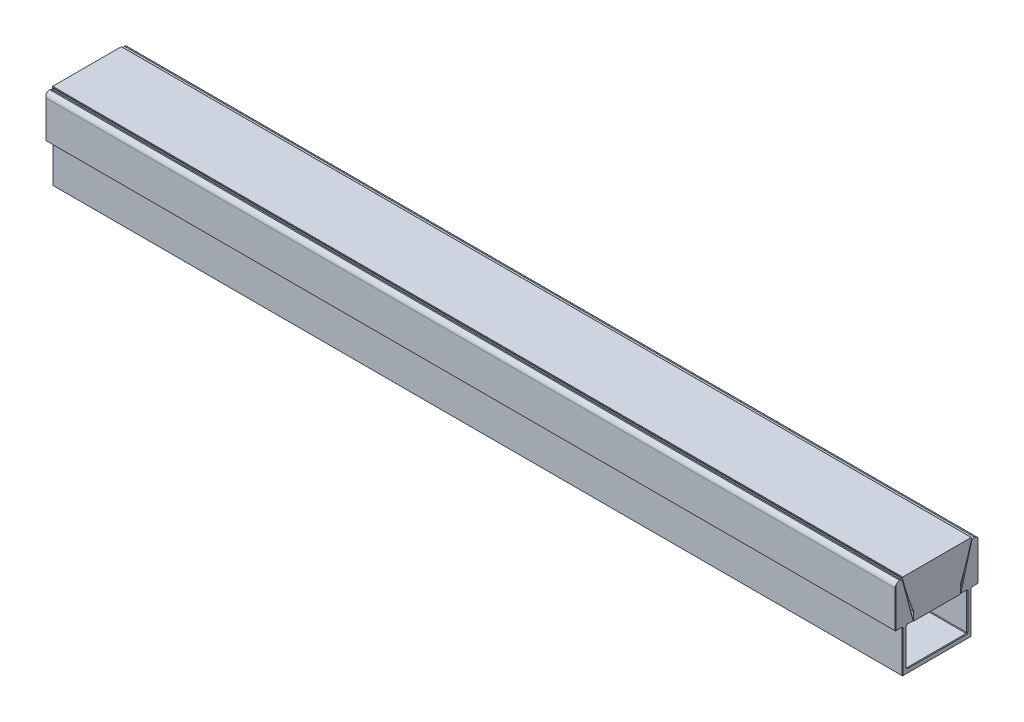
ISO-10303-21;
HEADER;
FILE_DESCRIPTION(('STEP AP214'),'2;1');
FILE_NAME('part.step','',(''),(''),'','','');
FILE_SCHEMA(('AUTOMOTIVE_DESIGN { 1 0 10303 214 1 1 1 1 }'));
ENDSEC;
DATA;
#1=APPLICATION_CONTEXT('core data for automotive mechanical design processes');
#2=APPLICATION_PROTOCOL_DEFINITION('international standard','automotive_design',2000,#1);
#3=PRODUCT_CONTEXT('',#1,'mechanical');
#4=PRODUCT('Part','Part','',(#3));
#5=PRODUCT_RELATED_PRODUCT_CATEGORY('part','',(#4));
#6=PRODUCT_DEFINITION_FORMATION('','',#4);
#7=PRODUCT_DEFINITION_CONTEXT('part definition',#1,'design');
#8=PRODUCT_DEFINITION('design','',#6,#7);
#9=PRODUCT_DEFINITION_SHAPE('','',#8);
#10=(LENGTH_UNIT() NAMED_UNIT(*) SI_UNIT(.MILLI.,.METRE.));
#11=(NAMED_UNIT(*) PLANE_ANGLE_UNIT() SI_UNIT($,.RADIAN.));
#12=(NAMED_UNIT(*) SI_UNIT($,.STERADIAN.) SOLID_ANGLE_UNIT());
#13=UNCERTAINTY_MEASURE_WITH_UNIT(LENGTH_MEASURE(1.E-05),#10,'distance_accuracy_value','');
#14=(GEOMETRIC_REPRESENTATION_CONTEXT(3) GLOBAL_UNCERTAINTY_ASSIGNED_CONTEXT((#13)) GLOBAL_UNIT_ASSIGNED_CONTEXT((#10,
#11,#12)) REPRESENTATION_CONTEXT('',''));
#15=CARTESIAN_POINT('',(0.,0.,0.));
#16=DIRECTION('',(0.,0.,1.));
#17=DIRECTION('',(1.,0.,0.));
#18=AXIS2_PLACEMENT_3D('',#15,#16,#17);
#19=CARTESIAN_POINT('',(254.,51.5,0.));
#20=DIRECTION('',(1.,0.,0.));
#21=DIRECTION('',(0.,0.,-1.));
#22=AXIS2_PLACEMENT_3D('',#19,#20,#21);
#23=PLANE('',#22);
#24=DIRECTION('',(0.,1.,0.));
#25=VECTOR('',#24,1.);
#26=CARTESIAN_POINT('',(254.,25.4,-13.93));
#27=LINE('',#26,#25);
#28=CARTESIAN_POINT('',(254.,25.4,-13.93));
#29=VERTEX_POINT('',#28);
#30=CARTESIAN_POINT('',(254.,30.4000000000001,-13.93));
#31=VERTEX_POINT('',#30);
#32=EDGE_CURVE('P0_E94',#29,#31,#27,.T.);
#33=ORIENTED_EDGE('',*,*,#32,.T.);
#34=CARTESIAN_POINT('',(254.,96.9707979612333,153.087769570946));
#35=DIRECTION('',(1.,0.,0.));
#36=DIRECTION('',(0.,0.,1.));
#37=AXIS2_PLACEMENT_3D('',#34,#35,#36);
#38=CIRCLE('',#37,179.796013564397);
#39=CARTESIAN_POINT('',(254.,50.8,-20.6789243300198));
#40=VERTEX_POINT('',#39);
#41=EDGE_CURVE('P0_E105',#31,#40,#38,.T.);
#42=ORIENTED_EDGE('',*,*,#41,.T.);
#43=DIRECTION('',(0.,-1.,0.));
#44=VECTOR('',#43,1.);
#45=CARTESIAN_POINT('',(254.,51.5,-20.6789243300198));
#46=LINE('',#45,#44);
#47=CARTESIAN_POINT('',(254.,51.3,-20.6789243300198));
#48=VERTEX_POINT('',#47);
#49=EDGE_CURVE('P0_E128',#48,#40,#46,.T.);
#50=ORIENTED_EDGE('',*,*,#49,.F.);
#51=CARTESIAN_POINT('',(254.,51.3,-20.4789243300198));
#52=DIRECTION('',(1.,0.,0.));
#53=DIRECTION('',(0.,0.,-1.));
#54=AXIS2_PLACEMENT_3D('',#51,#52,#53);
#55=CIRCLE('',#54,0.2);
#56=CARTESIAN_POINT('',(254.,51.5,-20.4789243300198));
#57=VERTEX_POINT('',#56);
#58=EDGE_CURVE('P0_E153',#48,#57,#55,.T.);
#59=ORIENTED_EDGE('',*,*,#58,.T.);
#60=DIRECTION('',(0.,0.,1.));
#61=VECTOR('',#60,1.);
#62=CARTESIAN_POINT('',(254.,51.5,0.));
#63=LINE('',#62,#61);
#64=CARTESIAN_POINT('',(254.,51.5,20.4789243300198));
#65=VERTEX_POINT('',#64);
#66=EDGE_CURVE('P0_E132',#57,#65,#63,.T.);
#67=ORIENTED_EDGE('',*,*,#66,.T.);
#68=CARTESIAN_POINT('',(254.,51.3,20.4789243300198));
#69=DIRECTION('',(1.,0.,0.));
#70=DIRECTION('',(0.,0.,-1.));
#71=AXIS2_PLACEMENT_3D('',#68,#69,#70);
#72=CIRCLE('',#71,0.2);
#73=CARTESIAN_POINT('',(254.,51.3,20.6789243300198));
#74=VERTEX_POINT('',#73);
#75=EDGE_CURVE('P0_E24',#65,#74,#72,.T.);
#76=ORIENTED_EDGE('',*,*,#75,.T.);
#77=DIRECTION('',(0.,-1.,0.));
#78=VECTOR('',#77,1.);
#79=CARTESIAN_POINT('',(254.,51.5,20.6789243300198));
#80=LINE('',#79,#78);
#81=CARTESIAN_POINT('',(254.,50.8,20.6789243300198));
#82=VERTEX_POINT('',#81);
#83=EDGE_CURVE('P0_E116',#74,#82,#80,.T.);
#84=ORIENTED_EDGE('',*,*,#83,.T.);
#85=CARTESIAN_POINT('',(254.,96.9707979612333,-153.087769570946));
#86=DIRECTION('',(-1.,0.,0.));
#87=DIRECTION('',(0.,0.,-1.));
#88=AXIS2_PLACEMENT_3D('',#85,#86,#87);
#89=CIRCLE('',#88,179.796013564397);
#90=CARTESIAN_POINT('',(254.,30.4000000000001,13.93));
#91=VERTEX_POINT('',#90);
#92=EDGE_CURVE('P0_E182',#91,#82,#89,.T.);
#93=ORIENTED_EDGE('',*,*,#92,.F.);
#94=DIRECTION('',(0.,1.,0.));
#95=VECTOR('',#94,1.);
#96=CARTESIAN_POINT('',(254.,25.4,13.93));
#97=LINE('',#96,#95);
#98=CARTESIAN_POINT('',(254.,25.4,13.93));
#99=VERTEX_POINT('',#98);
#100=EDGE_CURVE('P0_E112',#99,#91,#97,.T.);
#101=ORIENTED_EDGE('',*,*,#100,.F.);
#102=DIRECTION('',(0.,0.,-1.));
#103=VECTOR('',#102,1.);
#104=CARTESIAN_POINT('',(254.,25.4,13.93));
#105=LINE('',#104,#103);
#106=EDGE_CURVE('P0_E109',#99,#29,#105,.T.);
#107=ORIENTED_EDGE('',*,*,#106,.T.);
#108=EDGE_LOOP('',(#33,#42,#50,#59,#67,#76,#84,#93,#101,#107));
#109=FACE_BOUND('',#108,.T.);
#110=ADVANCED_FACE('P0_F16',(#109),#23,.T.);
#111=CARTESIAN_POINT('',(-254.,51.5,0.));
#112=DIRECTION('',(1.,0.,0.));
#113=DIRECTION('',(0.,0.,-1.));
#114=AXIS2_PLACEMENT_3D('',#111,#112,#113);
#115=PLANE('',#114);
#116=CARTESIAN_POINT('',(-254.,96.9707979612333,153.087769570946));
#117=DIRECTION('',(1.,0.,0.));
#118=DIRECTION('',(0.,0.,-1.));
#119=AXIS2_PLACEMENT_3D('',#116,#117,#118);
#120=CIRCLE('',#119,179.796013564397);
#121=CARTESIAN_POINT('',(-254.,50.8,-20.6789243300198));
#122=VERTEX_POINT('',#121);
#123=CARTESIAN_POINT('',(-254.,30.4000000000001,-13.93));
#124=VERTEX_POINT('',#123);
#125=EDGE_CURVE('P0_E188',#122,#124,#120,.F.);
#126=ORIENTED_EDGE('',*,*,#125,.T.);
#127=DIRECTION('',(0.,-1.,0.));
#128=VECTOR('',#127,1.);
#129=CARTESIAN_POINT('',(-254.,25.4,-13.93));
#130=LINE('',#129,#128);
#131=CARTESIAN_POINT('',(-254.,25.4,-13.93));
#132=VERTEX_POINT('',#131);
#133=EDGE_CURVE('P0_E185',#124,#132,#130,.T.);
#134=ORIENTED_EDGE('',*,*,#133,.T.);
#135=DIRECTION('',(0.,0.,-1.));
#136=VECTOR('',#135,1.);
#137=CARTESIAN_POINT('',(-254.,25.4,13.93));
#138=LINE('',#137,#136);
#139=CARTESIAN_POINT('',(-254.,25.4,13.93));
#140=VERTEX_POINT('',#139);
#141=EDGE_CURVE('P0_E121',#140,#132,#138,.T.);
#142=ORIENTED_EDGE('',*,*,#141,.F.);
#143=DIRECTION('',(0.,-1.,0.));
#144=VECTOR('',#143,1.);
#145=CARTESIAN_POINT('',(-254.,25.4,13.93));
#146=LINE('',#145,#144);
#147=CARTESIAN_POINT('',(-254.,30.4000000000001,13.93));
#148=VERTEX_POINT('',#147);
#149=EDGE_CURVE('P0_E177',#148,#140,#146,.T.);
#150=ORIENTED_EDGE('',*,*,#149,.F.);
#151=CARTESIAN_POINT('',(-254.,96.9707979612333,-153.087769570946));
#152=DIRECTION('',(1.,0.,0.));
#153=DIRECTION('',(0.,0.,-1.));
#154=AXIS2_PLACEMENT_3D('',#151,#152,#153);
#155=CIRCLE('',#154,179.796013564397);
#156=CARTESIAN_POINT('',(-254.,50.8,20.6789243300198));
#157=VERTEX_POINT('',#156);
#158=EDGE_CURVE('P0_E175',#157,#148,#155,.T.);
#159=ORIENTED_EDGE('',*,*,#158,.F.);
#160=DIRECTION('',(0.,-1.,0.));
#161=VECTOR('',#160,1.);
#162=CARTESIAN_POINT('',(-254.,51.5,20.6789243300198));
#163=LINE('',#162,#161);
#164=CARTESIAN_POINT('',(-254.,51.3,20.6789243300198));
#165=VERTEX_POINT('',#164);
#166=EDGE_CURVE('P0_E125',#165,#157,#163,.T.);
#167=ORIENTED_EDGE('',*,*,#166,.F.);
#168=CARTESIAN_POINT('',(-254.,51.3,20.4789243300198));
#169=DIRECTION('',(1.,0.,0.));
#170=DIRECTION('',(0.,0.,-1.));
#171=AXIS2_PLACEMENT_3D('',#168,#169,#170);
#172=CIRCLE('',#171,0.2);
#173=CARTESIAN_POINT('',(-254.,51.5,20.4789243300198));
#174=VERTEX_POINT('',#173);
#175=EDGE_CURVE('P0_E147',#165,#174,#172,.F.);
#176=ORIENTED_EDGE('',*,*,#175,.T.);
#177=DIRECTION('',(0.,0.,1.));
#178=VECTOR('',#177,1.);
#179=CARTESIAN_POINT('',(-254.,51.5,0.));
#180=LINE('',#179,#178);
#181=CARTESIAN_POINT('',(-254.,51.5,-20.4789243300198));
#182=VERTEX_POINT('',#181);
#183=EDGE_CURVE('P0_E122',#182,#174,#180,.T.);
#184=ORIENTED_EDGE('',*,*,#183,.F.);
#185=CARTESIAN_POINT('',(-254.,51.3,-20.4789243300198));
#186=DIRECTION('',(1.,0.,0.));
#187=DIRECTION('',(0.,0.,-1.));
#188=AXIS2_PLACEMENT_3D('',#185,#186,#187);
#189=CIRCLE('',#188,0.2);
#190=CARTESIAN_POINT('',(-254.,51.3,-20.6789243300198));
#191=VERTEX_POINT('',#190);
#192=EDGE_CURVE('P0_E145',#182,#191,#189,.F.);
#193=ORIENTED_EDGE('',*,*,#192,.T.);
#194=DIRECTION('',(0.,-1.,0.));
#195=VECTOR('',#194,1.);
#196=CARTESIAN_POINT('',(-254.,51.5,-20.6789243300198));
#197=LINE('',#196,#195);
#198=EDGE_CURVE('P0_E173',#191,#122,#197,.T.);
#199=ORIENTED_EDGE('',*,*,#198,.T.);
#200=EDGE_LOOP('',(#126,#134,#142,#150,#159,#167,#176,#184,#193,#199));
#201=FACE_BOUND('',#200,.T.);
#202=ADVANCED_FACE('P0_F166',(#201),#115,.F.);
#203=CARTESIAN_POINT('',(254.,51.5,0.));
#204=DIRECTION('',(0.,-1.,0.));
#205=DIRECTION('',(0.,0.,-1.));
#206=AXIS2_PLACEMENT_3D('',#203,#204,#205);
#207=PLANE('',#206);
#208=ORIENTED_EDGE('',*,*,#183,.T.);
#209=DIRECTION('',(-1.,0.,0.));
#210=VECTOR('',#209,1.);
#211=CARTESIAN_POINT('',(254.,51.5,20.4789243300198));
#212=LINE('',#211,#210);
#213=EDGE_CURVE('P0_E37',#174,#65,#212,.F.);
#214=ORIENTED_EDGE('',*,*,#213,.T.);
#215=ORIENTED_EDGE('',*,*,#66,.F.);
#216=DIRECTION('',(-1.,0.,0.));
#217=VECTOR('',#216,1.);
#218=CARTESIAN_POINT('',(-254.,51.5,-20.4789243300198));
#219=LINE('',#218,#217);
#220=EDGE_CURVE('P0_E149',#57,#182,#219,.T.);
#221=ORIENTED_EDGE('',*,*,#220,.T.);
#222=EDGE_LOOP('',(#208,#214,#215,#221));
#223=FACE_BOUND('',#222,.T.);
#224=ADVANCED_FACE('P0_F168',(#223),#207,.F.);
#225=CARTESIAN_POINT('',(254.,51.5,20.6789243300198));
#226=DIRECTION('',(0.,0.,-1.));
#227=DIRECTION('',(-1.,0.,0.));
#228=AXIS2_PLACEMENT_3D('',#225,#226,#227);
#229=PLANE('',#228);
#230=ORIENTED_EDGE('',*,*,#83,.F.);
#231=DIRECTION('',(-1.,0.,0.));
#232=VECTOR('',#231,1.);
#233=CARTESIAN_POINT('',(254.,51.3,20.6789243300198));
#234=LINE('',#233,#232);
#235=EDGE_CURVE('P0_E142',#74,#165,#234,.T.);
#236=ORIENTED_EDGE('',*,*,#235,.T.);
#237=ORIENTED_EDGE('',*,*,#166,.T.);
#238=DIRECTION('',(-1.,0.,0.));
#239=VECTOR('',#238,1.);
#240=CARTESIAN_POINT('',(254.,50.8,20.6789243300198));
#241=LINE('',#240,#239);
#242=EDGE_CURVE('P0_E140',#82,#157,#241,.T.);
#243=ORIENTED_EDGE('',*,*,#242,.F.);
#244=EDGE_LOOP('',(#230,#236,#237,#243));
#245=FACE_BOUND('',#244,.T.);
#246=ADVANCED_FACE('P0_F160',(#245),#229,.F.);
#247=CARTESIAN_POINT('',(254.,25.4,13.93));
#248=DIRECTION('',(0.,1.,0.));
#249=DIRECTION('',(0.,0.,1.));
#250=AXIS2_PLACEMENT_3D('',#247,#248,#249);
#251=PLANE('',#250);
#252=ORIENTED_EDGE('',*,*,#141,.T.);
#253=DIRECTION('',(-1.,0.,0.));
#254=VECTOR('',#253,1.);
#255=CARTESIAN_POINT('',(254.,25.4,-13.93));
#256=LINE('',#255,#254);
#257=EDGE_CURVE('P0_E98',#29,#132,#256,.T.);
#258=ORIENTED_EDGE('',*,*,#257,.F.);
#259=ORIENTED_EDGE('',*,*,#106,.F.);
#260=DIRECTION('',(-1.,0.,0.));
#261=VECTOR('',#260,1.);
#262=CARTESIAN_POINT('',(254.,25.4,13.93));
#263=LINE('',#262,#261);
#264=EDGE_CURVE('P0_E115',#99,#140,#263,.T.);
#265=ORIENTED_EDGE('',*,*,#264,.T.);
#266=EDGE_LOOP('',(#252,#258,#259,#265));
#267=FACE_BOUND('',#266,.T.);
#268=ADVANCED_FACE('P0_F119',(#267),#251,.F.);
#269=CARTESIAN_POINT('',(254.,51.5,-20.6789243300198));
#270=DIRECTION('',(0.,0.,-1.));
#271=DIRECTION('',(-1.,0.,0.));
#272=AXIS2_PLACEMENT_3D('',#269,#270,#271);
#273=PLANE('',#272);
#274=ORIENTED_EDGE('',*,*,#198,.F.);
#275=DIRECTION('',(-1.,0.,0.));
#276=VECTOR('',#275,1.);
#277=CARTESIAN_POINT('',(254.,51.3,-20.6789243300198));
#278=LINE('',#277,#276);
#279=EDGE_CURVE('P0_E11',#191,#48,#278,.F.);
#280=ORIENTED_EDGE('',*,*,#279,.T.);
#281=ORIENTED_EDGE('',*,*,#49,.T.);
#282=DIRECTION('',(-1.,0.,0.));
#283=VECTOR('',#282,1.);
#284=CARTESIAN_POINT('',(254.,50.8,-20.6789243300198));
#285=LINE('',#284,#283);
#286=EDGE_CURVE('P0_E123',#40,#122,#285,.T.);
#287=ORIENTED_EDGE('',*,*,#286,.T.);
#288=EDGE_LOOP('',(#274,#280,#281,#287));
#289=FACE_BOUND('',#288,.T.);
#290=ADVANCED_FACE('P0_F174',(#289),#273,.T.);
#291=CARTESIAN_POINT('',(254.,51.3,20.4789243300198));
#292=DIRECTION('',(-1.,0.,0.));
#293=DIRECTION('',(0.,0.,1.));
#294=AXIS2_PLACEMENT_3D('',#291,#292,#293);
#295=CYLINDRICAL_SURFACE('',#294,0.2);
#296=ORIENTED_EDGE('',*,*,#75,.F.);
#297=ORIENTED_EDGE('',*,*,#213,.F.);
#298=ORIENTED_EDGE('',*,*,#175,.F.);
#299=ORIENTED_EDGE('',*,*,#235,.F.);
#300=EDGE_LOOP('',(#296,#297,#298,#299));
#301=FACE_BOUND('',#300,.T.);
#302=ADVANCED_FACE('P0_F162',(#301),#295,.T.);
#303=CARTESIAN_POINT('',(254.,51.3,-20.4789243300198));
#304=DIRECTION('',(1.,0.,0.));
#305=DIRECTION('',(0.,0.,-1.));
#306=AXIS2_PLACEMENT_3D('',#303,#304,#305);
#307=CYLINDRICAL_SURFACE('',#306,0.2);
#308=ORIENTED_EDGE('',*,*,#58,.F.);
#309=ORIENTED_EDGE('',*,*,#279,.F.);
#310=ORIENTED_EDGE('',*,*,#192,.F.);
#311=ORIENTED_EDGE('',*,*,#220,.F.);
#312=EDGE_LOOP('',(#308,#309,#310,#311));
#313=FACE_BOUND('',#312,.T.);
#314=ADVANCED_FACE('P0_F18',(#313),#307,.T.);
#315=CARTESIAN_POINT('',(-280.281323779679,25.4,13.93));
#316=DIRECTION('',(0.,0.,-1.));
#317=DIRECTION('',(0.,1.,0.));
#318=AXIS2_PLACEMENT_3D('',#315,#316,#317);
#319=PLANE('',#318);
#320=ORIENTED_EDGE('',*,*,#149,.T.);
#321=ORIENTED_EDGE('',*,*,#264,.F.);
#322=ORIENTED_EDGE('',*,*,#100,.T.);
#323=DIRECTION('',(1.,0.,0.));
#324=VECTOR('',#323,1.);
#325=CARTESIAN_POINT('',(-280.281323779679,30.4000000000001,13.93));
#326=LINE('',#325,#324);
#327=EDGE_CURVE('P0_E180',#148,#91,#326,.T.);
#328=ORIENTED_EDGE('',*,*,#327,.F.);
#329=EDGE_LOOP('',(#320,#321,#322,#328));
#330=FACE_BOUND('',#329,.T.);
#331=ADVANCED_FACE('P0_F202',(#330),#319,.F.);
#332=CARTESIAN_POINT('',(-280.281323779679,96.9707979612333,-153.087769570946));
#333=DIRECTION('',(1.,0.,0.));
#334=DIRECTION('',(0.,0.,-1.));
#335=AXIS2_PLACEMENT_3D('',#332,#333,#334);
#336=CYLINDRICAL_SURFACE('',#335,179.796013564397);
#337=ORIENTED_EDGE('',*,*,#158,.T.);
#338=ORIENTED_EDGE('',*,*,#327,.T.);
#339=ORIENTED_EDGE('',*,*,#92,.T.);
#340=ORIENTED_EDGE('',*,*,#242,.T.);
#341=EDGE_LOOP('',(#337,#338,#339,#340));
#342=FACE_BOUND('',#341,.T.);
#343=ADVANCED_FACE('P0_F194',(#342),#336,.T.);
#344=CARTESIAN_POINT('',(-280.281323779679,96.9707979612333,153.087769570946));
#345=DIRECTION('',(1.,0.,0.));
#346=DIRECTION('',(0.,0.,-1.));
#347=AXIS2_PLACEMENT_3D('',#344,#345,#346);
#348=CYLINDRICAL_SURFACE('',#347,179.796013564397);
#349=ORIENTED_EDGE('',*,*,#286,.F.);
#350=ORIENTED_EDGE('',*,*,#41,.F.);
#351=DIRECTION('',(1.,0.,0.));
#352=VECTOR('',#351,1.);
#353=CARTESIAN_POINT('',(-280.281323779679,30.4000000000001,-13.93));
#354=LINE('',#353,#352);
#355=EDGE_CURVE('P0_E101',#124,#31,#354,.T.);
#356=ORIENTED_EDGE('',*,*,#355,.F.);
#357=ORIENTED_EDGE('',*,*,#125,.F.);
#358=EDGE_LOOP('',(#349,#350,#356,#357));
#359=FACE_BOUND('',#358,.T.);
#360=ADVANCED_FACE('P0_F192',(#359),#348,.T.);
#361=CARTESIAN_POINT('',(-280.281323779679,25.4,-13.93));
#362=DIRECTION('',(0.,0.,-1.));
#363=DIRECTION('',(0.,1.,0.));
#364=AXIS2_PLACEMENT_3D('',#361,#362,#363);
#365=PLANE('',#364);
#366=ORIENTED_EDGE('',*,*,#355,.T.);
#367=ORIENTED_EDGE('',*,*,#32,.F.);
#368=ORIENTED_EDGE('',*,*,#257,.T.);
#369=ORIENTED_EDGE('',*,*,#133,.F.);
#370=EDGE_LOOP('',(#366,#367,#368,#369));
#371=FACE_BOUND('',#370,.T.);
#372=ADVANCED_FACE('P0_F96',(#371),#365,.T.);
#373=CLOSED_SHELL('',(#110,#202,#224,#246,#268,#290,#302,#314,#331,#343,#360,#372));
#374=MANIFOLD_SOLID_BREP('P0_B1',#373);
#375=CARTESIAN_POINT('',(-254.,0.,0.));
#376=DIRECTION('',(-1.,0.,0.));
#377=DIRECTION('',(0.,0.,1.));
#378=AXIS2_PLACEMENT_3D('',#375,#376,#377);
#379=PLANE('',#378);
#380=CARTESIAN_POINT('',(-254.,47.8,-22.9068818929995));
#381=DIRECTION('',(-1.,0.,0.));
#382=DIRECTION('',(0.,0.,1.));
#383=AXIS2_PLACEMENT_3D('',#380,#381,#382);
#384=CIRCLE('',#383,3.);
#385=CARTESIAN_POINT('',(-254.,49.8396740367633,-20.7069432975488));
#386=VERTEX_POINT('',#385);
#387=CARTESIAN_POINT('',(-254.,50.7530916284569,-22.3784409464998));
#388=VERTEX_POINT('',#387);
#389=EDGE_CURVE('P1_E813',#386,#388,#384,.T.);
#390=ORIENTED_EDGE('',*,*,#389,.T.);
#391=CARTESIAN_POINT('',(-254.,47.8,-21.85));
#392=DIRECTION('',(-1.,0.,0.));
#393=DIRECTION('',(0.,0.,1.));
#394=AXIS2_PLACEMENT_3D('',#391,#392,#393);
#395=CIRCLE('',#394,3.);
#396=CARTESIAN_POINT('',(-254.,49.2062361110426,-24.4999999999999));
#397=VERTEX_POINT('',#396);
#398=EDGE_CURVE('P1_E815',#388,#397,#395,.T.);
#399=ORIENTED_EDGE('',*,*,#398,.T.);
#400=DIRECTION('',(0.,-1.,0.));
#401=VECTOR('',#400,1.);
#402=CARTESIAN_POINT('',(-254.,0.,-24.4999999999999));
#403=LINE('',#402,#401);
#404=CARTESIAN_POINT('',(-254.,25.7500000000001,-24.4999999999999));
#405=VERTEX_POINT('',#404);
#406=EDGE_CURVE('P1_E486',#397,#405,#403,.T.);
#407=ORIENTED_EDGE('',*,*,#406,.T.);
#408=DIRECTION('',(0.,0.,1.));
#409=VECTOR('',#408,1.);
#410=CARTESIAN_POINT('',(-254.,25.7500000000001,0.));
#411=LINE('',#410,#409);
#412=CARTESIAN_POINT('',(-254.,25.7500000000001,-20.9500000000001));
#413=VERTEX_POINT('',#412);
#414=EDGE_CURVE('P1_E484',#405,#413,#411,.T.);
#415=ORIENTED_EDGE('',*,*,#414,.T.);
#416=DIRECTION('',(0.,0.707106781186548,-0.707106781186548));
#417=VECTOR('',#416,1.);
#418=CARTESIAN_POINT('',(-254.,2.4,2.4));
#419=LINE('',#418,#417);
#420=CARTESIAN_POINT('',(-254.,25.4,-20.6));
#421=VERTEX_POINT('',#420);
#422=EDGE_CURVE('P1_E481',#421,#413,#419,.T.);
#423=ORIENTED_EDGE('',*,*,#422,.F.);
#424=DIRECTION('',(0.,0.707106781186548,-0.707106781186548));
#425=VECTOR('',#424,1.);
#426=CARTESIAN_POINT('',(-254.,2.4,2.4));
#427=LINE('',#426,#425);
#428=CARTESIAN_POINT('',(-254.,25.0499999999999,-20.2499999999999));
#429=VERTEX_POINT('',#428);
#430=EDGE_CURVE('P1_E478',#429,#421,#427,.T.);
#431=ORIENTED_EDGE('',*,*,#430,.F.);
#432=DIRECTION('',(0.,-1.,0.));
#433=VECTOR('',#432,1.);
#434=CARTESIAN_POINT('',(-254.,0.,-20.2499999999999));
#435=LINE('',#434,#433);
#436=CARTESIAN_POINT('',(-254.,0.350000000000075,-20.2499999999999));
#437=VERTEX_POINT('',#436);
#438=EDGE_CURVE('P1_E476',#429,#437,#435,.T.);
#439=ORIENTED_EDGE('',*,*,#438,.T.);
#440=DIRECTION('',(0.,0.,1.));
#441=VECTOR('',#440,1.);
#442=CARTESIAN_POINT('',(-254.,0.35000000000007,20.6));
#443=LINE('',#442,#441);
#444=CARTESIAN_POINT('',(-254.,0.35000000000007,20.2499999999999));
#445=VERTEX_POINT('',#444);
#446=EDGE_CURVE('P1_E474',#437,#445,#443,.T.);
#447=ORIENTED_EDGE('',*,*,#446,.T.);
#448=DIRECTION('',(0.,1.,0.));
#449=VECTOR('',#448,1.);
#450=CARTESIAN_POINT('',(-254.,25.4,20.2499999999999));
#451=LINE('',#450,#449);
#452=CARTESIAN_POINT('',(-254.,25.0499999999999,20.2499999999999));
#453=VERTEX_POINT('',#452);
#454=EDGE_CURVE('P1_E472',#445,#453,#451,.T.);
#455=ORIENTED_EDGE('',*,*,#454,.T.);
#456=DIRECTION('',(0.,-0.707106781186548,-0.707106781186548));
#457=VECTOR('',#456,1.);
#458=CARTESIAN_POINT('',(-254.,2.4,-2.4));
#459=LINE('',#458,#457);
#460=CARTESIAN_POINT('',(-254.,25.4,20.6));
#461=VERTEX_POINT('',#460);
#462=EDGE_CURVE('P1_E469',#461,#453,#459,.T.);
#463=ORIENTED_EDGE('',*,*,#462,.F.);
#464=DIRECTION('',(0.,-0.707106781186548,-0.707106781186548));
#465=VECTOR('',#464,1.);
#466=CARTESIAN_POINT('',(-254.,2.4,-2.4));
#467=LINE('',#466,#465);
#468=CARTESIAN_POINT('',(-254.,25.7500000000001,20.9500000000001));
#469=VERTEX_POINT('',#468);
#470=EDGE_CURVE('P1_E466',#469,#461,#467,.T.);
#471=ORIENTED_EDGE('',*,*,#470,.F.);
#472=DIRECTION('',(0.,0.,1.));
#473=VECTOR('',#472,1.);
#474=CARTESIAN_POINT('',(-254.,25.7500000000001,24.85));
#475=LINE('',#474,#473);
#476=CARTESIAN_POINT('',(-254.,25.7500000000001,24.5));
#477=VERTEX_POINT('',#476);
#478=EDGE_CURVE('P1_E464',#469,#477,#475,.T.);
#479=ORIENTED_EDGE('',*,*,#478,.T.);
#480=DIRECTION('',(0.,1.,0.));
#481=VECTOR('',#480,1.);
#482=CARTESIAN_POINT('',(-254.,50.8,24.5));
#483=LINE('',#482,#481);
#484=CARTESIAN_POINT('',(-254.,49.2062361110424,24.5));
#485=VERTEX_POINT('',#484);
#486=EDGE_CURVE('P1_E461',#477,#485,#483,.T.);
#487=ORIENTED_EDGE('',*,*,#486,.T.);
#488=CARTESIAN_POINT('',(-254.,47.8,21.85));
#489=DIRECTION('',(-1.,0.,0.));
#490=DIRECTION('',(0.,0.,1.));
#491=AXIS2_PLACEMENT_3D('',#488,#489,#490);
#492=CIRCLE('',#491,3.);
#493=CARTESIAN_POINT('',(-254.,50.7530916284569,22.3784409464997));
#494=VERTEX_POINT('',#493);
#495=EDGE_CURVE('P1_E811',#485,#494,#492,.T.);
#496=ORIENTED_EDGE('',*,*,#495,.T.);
#497=CARTESIAN_POINT('',(-254.,47.8,22.9068818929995));
#498=DIRECTION('',(-1.,0.,0.));
#499=DIRECTION('',(0.,0.,1.));
#500=AXIS2_PLACEMENT_3D('',#497,#498,#499);
#501=CIRCLE('',#500,3.);
#502=CARTESIAN_POINT('',(-254.,49.8396740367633,20.7069432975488));
#503=VERTEX_POINT('',#502);
#504=EDGE_CURVE('P1_E604',#494,#503,#501,.T.);
#505=ORIENTED_EDGE('',*,*,#504,.T.);
#506=DIRECTION('',(0.,-0.966455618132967,-0.256833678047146));
#507=VECTOR('',#506,1.);
#508=CARTESIAN_POINT('',(-254.,25.3101082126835,14.1882594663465));
#509=LINE('',#508,#507);
#510=CARTESIAN_POINT('',(-254.,25.7499999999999,14.3051598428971));
#511=VERTEX_POINT('',#510);
#512=EDGE_CURVE('P1_E488',#503,#511,#509,.T.);
#513=ORIENTED_EDGE('',*,*,#512,.T.);
#514=DIRECTION('',(0.,0.,1.));
#515=VECTOR('',#514,1.);
#516=CARTESIAN_POINT('',(-254.,25.7499999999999,18.1));
#517=LINE('',#516,#515);
#518=CARTESIAN_POINT('',(-254.,25.7499999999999,17.7500000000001));
#519=VERTEX_POINT('',#518);
#520=EDGE_CURVE('P1_E490',#511,#519,#517,.T.);
#521=ORIENTED_EDGE('',*,*,#520,.T.);
#522=DIRECTION('',(0.,0.707106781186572,-0.707106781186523));
#523=VECTOR('',#522,1.);
#524=CARTESIAN_POINT('',(-254.,21.7499999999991,21.7500000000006));
#525=LINE('',#524,#523);
#526=CARTESIAN_POINT('',(-254.,25.4,18.1));
#527=VERTEX_POINT('',#526);
#528=EDGE_CURVE('P1_E492',#527,#519,#525,.T.);
#529=ORIENTED_EDGE('',*,*,#528,.F.);
#530=DIRECTION('',(0.,0.707106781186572,-0.707106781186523));
#531=VECTOR('',#530,1.);
#532=CARTESIAN_POINT('',(-254.,21.7499999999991,21.7500000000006));
#533=LINE('',#532,#531);
#534=CARTESIAN_POINT('',(-254.,25.0500000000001,18.4499999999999));
#535=VERTEX_POINT('',#534);
#536=EDGE_CURVE('P1_E495',#535,#527,#533,.T.);
#537=ORIENTED_EDGE('',*,*,#536,.F.);
#538=DIRECTION('',(0.,-1.,0.));
#539=VECTOR('',#538,1.);
#540=CARTESIAN_POINT('',(-254.,3.,18.4499999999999));
#541=LINE('',#540,#539);
#542=CARTESIAN_POINT('',(-254.,3.34999999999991,18.4499999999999));
#543=VERTEX_POINT('',#542);
#544=EDGE_CURVE('P1_E498',#535,#543,#541,.T.);
#545=ORIENTED_EDGE('',*,*,#544,.T.);
#546=DIRECTION('',(0.,0.707106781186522,0.707106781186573));
#547=VECTOR('',#546,1.);
#548=CARTESIAN_POINT('',(-254.,-7.54999999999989,7.54999999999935));
#549=LINE('',#548,#547);
#550=CARTESIAN_POINT('',(-254.,3.,18.1));
#551=VERTEX_POINT('',#550);
#552=EDGE_CURVE('P1_E500',#551,#543,#549,.T.);
#553=ORIENTED_EDGE('',*,*,#552,.F.);
#554=DIRECTION('',(0.,0.707106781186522,0.707106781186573));
#555=VECTOR('',#554,1.);
#556=CARTESIAN_POINT('',(-254.,-7.54999999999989,7.54999999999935));
#557=LINE('',#556,#555);
#558=CARTESIAN_POINT('',(-254.,2.65000000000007,17.7500000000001));
#559=VERTEX_POINT('',#558);
#560=EDGE_CURVE('P1_E503',#559,#551,#557,.T.);
#561=ORIENTED_EDGE('',*,*,#560,.F.);
#562=DIRECTION('',(0.,0.,-1.));
#563=VECTOR('',#562,1.);
#564=CARTESIAN_POINT('',(-254.,2.65000000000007,-18.1));
#565=LINE('',#564,#563);
#566=CARTESIAN_POINT('',(-254.,2.65000000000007,-17.7500000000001));
#567=VERTEX_POINT('',#566);
#568=EDGE_CURVE('P1_E506',#559,#567,#565,.T.);
#569=ORIENTED_EDGE('',*,*,#568,.T.);
#570=DIRECTION('',(0.,-0.707106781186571,0.707106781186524));
#571=VECTOR('',#570,1.);
#572=CARTESIAN_POINT('',(-254.,-7.5500000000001,-7.5500000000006));
#573=LINE('',#572,#571);
#574=CARTESIAN_POINT('',(-254.,3.,-18.1));
#575=VERTEX_POINT('',#574);
#576=EDGE_CURVE('P1_E508',#575,#567,#573,.T.);
#577=ORIENTED_EDGE('',*,*,#576,.F.);
#578=DIRECTION('',(0.,-0.707106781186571,0.707106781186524));
#579=VECTOR('',#578,1.);
#580=CARTESIAN_POINT('',(-254.,-7.5500000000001,-7.5500000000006));
#581=LINE('',#580,#579);
#582=CARTESIAN_POINT('',(-254.,3.34999999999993,-18.4499999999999));
#583=VERTEX_POINT('',#582);
#584=EDGE_CURVE('P1_E511',#583,#575,#581,.T.);
#585=ORIENTED_EDGE('',*,*,#584,.F.);
#586=DIRECTION('',(0.,1.,0.));
#587=VECTOR('',#586,1.);
#588=CARTESIAN_POINT('',(-254.,0.,-18.4499999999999));
#589=LINE('',#588,#587);
#590=CARTESIAN_POINT('',(-254.,25.0500000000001,-18.4499999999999));
#591=VERTEX_POINT('',#590);
#592=EDGE_CURVE('P1_E514',#583,#591,#589,.T.);
#593=ORIENTED_EDGE('',*,*,#592,.T.);
#594=DIRECTION('',(0.,-0.707106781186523,-0.707106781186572));
#595=VECTOR('',#594,1.);
#596=CARTESIAN_POINT('',(-254.,21.7500000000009,-21.7499999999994));
#597=LINE('',#596,#595);
#598=CARTESIAN_POINT('',(-254.,25.4,-18.1));
#599=VERTEX_POINT('',#598);
#600=EDGE_CURVE('P1_E516',#599,#591,#597,.T.);
#601=ORIENTED_EDGE('',*,*,#600,.F.);
#602=DIRECTION('',(0.,-0.707106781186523,-0.707106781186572));
#603=VECTOR('',#602,1.);
#604=CARTESIAN_POINT('',(-254.,21.7500000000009,-21.7499999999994));
#605=LINE('',#604,#603);
#606=CARTESIAN_POINT('',(-254.,25.7499999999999,-17.7500000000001));
#607=VERTEX_POINT('',#606);
#608=EDGE_CURVE('P1_E519',#607,#599,#605,.T.);
#609=ORIENTED_EDGE('',*,*,#608,.F.);
#610=DIRECTION('',(0.,0.,1.));
#611=VECTOR('',#610,1.);
#612=CARTESIAN_POINT('',(-254.,25.7499999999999,0.));
#613=LINE('',#612,#611);
#614=CARTESIAN_POINT('',(-254.,25.7499999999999,-14.3051598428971));
#615=VERTEX_POINT('',#614);
#616=EDGE_CURVE('P1_E522',#607,#615,#613,.T.);
#617=ORIENTED_EDGE('',*,*,#616,.T.);
#618=DIRECTION('',(0.,0.966455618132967,-0.256833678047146));
#619=VECTOR('',#618,1.);
#620=CARTESIAN_POINT('',(-254.,-1.85224207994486,-6.96991834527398));
#621=LINE('',#620,#619);
#622=EDGE_CURVE('P1_E524',#615,#386,#621,.T.);
#623=ORIENTED_EDGE('',*,*,#622,.T.);
#624=EDGE_LOOP('',(#390,#399,#407,#415,#423,#431,#439,#447,#455,#463,#471,#479,#487,#496,#505,
#513,#521,#529,#537,#545,#553,#561,#569,#577,#585,#593,#601,#609,#617,#623));
#625=FACE_BOUND('',#624,.T.);
#626=ADVANCED_FACE('P1_F15',(#625),#379,.T.);
#627=CARTESIAN_POINT('',(254.,0.,0.));
#628=DIRECTION('',(-1.,0.,0.));
#629=DIRECTION('',(0.,0.,1.));
#630=AXIS2_PLACEMENT_3D('',#627,#628,#629);
#631=PLANE('',#630);
#632=DIRECTION('',(0.,1.,0.));
#633=VECTOR('',#632,1.);
#634=CARTESIAN_POINT('',(254.,50.8,-24.4999999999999));
#635=LINE('',#634,#633);
#636=CARTESIAN_POINT('',(254.,25.7500000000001,-24.4999999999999));
#637=VERTEX_POINT('',#636);
#638=CARTESIAN_POINT('',(254.,49.2062361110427,-24.4999999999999));
#639=VERTEX_POINT('',#638);
#640=EDGE_CURVE('P1_E399',#637,#639,#635,.T.);
#641=ORIENTED_EDGE('',*,*,#640,.T.);
#642=CARTESIAN_POINT('',(254.,47.8,-21.85));
#643=DIRECTION('',(-1.,0.,0.));
#644=DIRECTION('',(0.,0.,1.));
#645=AXIS2_PLACEMENT_3D('',#642,#643,#644);
#646=CIRCLE('',#645,3.);
#647=CARTESIAN_POINT('',(254.,50.7530916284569,-22.3784409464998));
#648=VERTEX_POINT('',#647);
#649=EDGE_CURVE('P1_E830',#639,#648,#646,.F.);
#650=ORIENTED_EDGE('',*,*,#649,.T.);
#651=CARTESIAN_POINT('',(254.,47.8,-22.9068818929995));
#652=DIRECTION('',(-1.,0.,0.));
#653=DIRECTION('',(0.,0.,1.));
#654=AXIS2_PLACEMENT_3D('',#651,#652,#653);
#655=CIRCLE('',#654,3.);
#656=CARTESIAN_POINT('',(254.,49.8396740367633,-20.7069432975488));
#657=VERTEX_POINT('',#656);
#658=EDGE_CURVE('P1_E828',#648,#657,#655,.F.);
#659=ORIENTED_EDGE('',*,*,#658,.T.);
#660=DIRECTION('',(0.,-0.966455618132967,0.256833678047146));
#661=VECTOR('',#660,1.);
#662=CARTESIAN_POINT('',(254.,25.3101082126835,-14.1882594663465));
#663=LINE('',#662,#661);
#664=CARTESIAN_POINT('',(254.,25.7499999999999,-14.3051598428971));
#665=VERTEX_POINT('',#664);
#666=EDGE_CURVE('P1_E430',#657,#665,#663,.T.);
#667=ORIENTED_EDGE('',*,*,#666,.T.);
#668=DIRECTION('',(0.,0.,-1.));
#669=VECTOR('',#668,1.);
#670=CARTESIAN_POINT('',(254.,25.7499999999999,-18.1));
#671=LINE('',#670,#669);
#672=CARTESIAN_POINT('',(254.,25.7499999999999,-17.7500000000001));
#673=VERTEX_POINT('',#672);
#674=EDGE_CURVE('P1_E426',#665,#673,#671,.T.);
#675=ORIENTED_EDGE('',*,*,#674,.T.);
#676=DIRECTION('',(0.,0.707106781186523,0.707106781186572));
#677=VECTOR('',#676,1.);
#678=CARTESIAN_POINT('',(254.,25.7499999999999,-17.7500000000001));
#679=LINE('',#678,#677);
#680=CARTESIAN_POINT('',(254.,25.4,-18.1));
#681=VERTEX_POINT('',#680);
#682=EDGE_CURVE('P1_E423',#681,#673,#679,.T.);
#683=ORIENTED_EDGE('',*,*,#682,.F.);
#684=DIRECTION('',(0.,0.707106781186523,0.707106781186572));
#685=VECTOR('',#684,1.);
#686=CARTESIAN_POINT('',(254.,25.7499999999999,-17.7500000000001));
#687=LINE('',#686,#685);
#688=CARTESIAN_POINT('',(254.,25.0500000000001,-18.4499999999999));
#689=VERTEX_POINT('',#688);
#690=EDGE_CURVE('P1_E414',#689,#681,#687,.T.);
#691=ORIENTED_EDGE('',*,*,#690,.F.);
#692=DIRECTION('',(0.,-1.,0.));
#693=VECTOR('',#692,1.);
#694=CARTESIAN_POINT('',(254.,3.,-18.4499999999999));
#695=LINE('',#694,#693);
#696=CARTESIAN_POINT('',(254.,3.34999999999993,-18.4499999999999));
#697=VERTEX_POINT('',#696);
#698=EDGE_CURVE('P1_E410',#689,#697,#695,.T.);
#699=ORIENTED_EDGE('',*,*,#698,.T.);
#700=DIRECTION('',(0.,0.707106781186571,-0.707106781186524));
#701=VECTOR('',#700,1.);
#702=CARTESIAN_POINT('',(254.,3.34999999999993,-18.4499999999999));
#703=LINE('',#702,#701);
#704=CARTESIAN_POINT('',(254.,3.,-18.1));
#705=VERTEX_POINT('',#704);
#706=EDGE_CURVE('P1_E404',#705,#697,#703,.T.);
#707=ORIENTED_EDGE('',*,*,#706,.F.);
#708=DIRECTION('',(0.,0.707106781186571,-0.707106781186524));
#709=VECTOR('',#708,1.);
#710=CARTESIAN_POINT('',(254.,3.34999999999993,-18.4499999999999));
#711=LINE('',#710,#709);
#712=CARTESIAN_POINT('',(254.,2.65000000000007,-17.7500000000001));
#713=VERTEX_POINT('',#712);
#714=EDGE_CURVE('P1_E407',#713,#705,#711,.T.);
#715=ORIENTED_EDGE('',*,*,#714,.F.);
#716=DIRECTION('',(0.,0.,1.));
#717=VECTOR('',#716,1.);
#718=CARTESIAN_POINT('',(254.,2.65000000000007,0.));
#719=LINE('',#718,#717);
#720=CARTESIAN_POINT('',(254.,2.65000000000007,17.7500000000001));
#721=VERTEX_POINT('',#720);
#722=EDGE_CURVE('P1_E412',#713,#721,#719,.T.);
#723=ORIENTED_EDGE('',*,*,#722,.T.);
#724=DIRECTION('',(0.,-0.707106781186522,-0.707106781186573));
#725=VECTOR('',#724,1.);
#726=CARTESIAN_POINT('',(254.,2.65000000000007,17.7500000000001));
#727=LINE('',#726,#725);
#728=CARTESIAN_POINT('',(254.,3.,18.1));
#729=VERTEX_POINT('',#728);
#730=EDGE_CURVE('P1_E417',#729,#721,#727,.T.);
#731=ORIENTED_EDGE('',*,*,#730,.F.);
#732=DIRECTION('',(0.,-0.707106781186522,-0.707106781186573));
#733=VECTOR('',#732,1.);
#734=CARTESIAN_POINT('',(254.,2.65000000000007,17.7500000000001));
#735=LINE('',#734,#733);
#736=CARTESIAN_POINT('',(254.,3.34999999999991,18.4499999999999));
#737=VERTEX_POINT('',#736);
#738=EDGE_CURVE('P1_E420',#737,#729,#735,.T.);
#739=ORIENTED_EDGE('',*,*,#738,.F.);
#740=DIRECTION('',(0.,1.,0.));
#741=VECTOR('',#740,1.);
#742=CARTESIAN_POINT('',(254.,0.,18.4499999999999));
#743=LINE('',#742,#741);
#744=CARTESIAN_POINT('',(254.,25.0500000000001,18.4499999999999));
#745=VERTEX_POINT('',#744);
#746=EDGE_CURVE('P1_E428',#737,#745,#743,.T.);
#747=ORIENTED_EDGE('',*,*,#746,.T.);
#748=DIRECTION('',(0.,-0.707106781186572,0.707106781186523));
#749=VECTOR('',#748,1.);
#750=CARTESIAN_POINT('',(254.,25.0500000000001,18.4499999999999));
#751=LINE('',#750,#749);
#752=CARTESIAN_POINT('',(254.,25.4,18.1));
#753=VERTEX_POINT('',#752);
#754=EDGE_CURVE('P1_E432',#753,#745,#751,.T.);
#755=ORIENTED_EDGE('',*,*,#754,.F.);
#756=DIRECTION('',(0.,-0.707106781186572,0.707106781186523));
#757=VECTOR('',#756,1.);
#758=CARTESIAN_POINT('',(254.,25.0500000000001,18.4499999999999));
#759=LINE('',#758,#757);
#760=CARTESIAN_POINT('',(254.,25.7499999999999,17.7500000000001));
#761=VERTEX_POINT('',#760);
#762=EDGE_CURVE('P1_E435',#761,#753,#759,.T.);
#763=ORIENTED_EDGE('',*,*,#762,.F.);
#764=DIRECTION('',(0.,0.,-1.));
#765=VECTOR('',#764,1.);
#766=CARTESIAN_POINT('',(254.,25.7499999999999,0.));
#767=LINE('',#766,#765);
#768=CARTESIAN_POINT('',(254.,25.7499999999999,14.3051598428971));
#769=VERTEX_POINT('',#768);
#770=EDGE_CURVE('P1_E438',#761,#769,#767,.T.);
#771=ORIENTED_EDGE('',*,*,#770,.T.);
#772=DIRECTION('',(0.,0.966455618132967,0.256833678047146));
#773=VECTOR('',#772,1.);
#774=CARTESIAN_POINT('',(254.,-1.85224207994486,6.96991834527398));
#775=LINE('',#774,#773);
#776=CARTESIAN_POINT('',(254.,49.8396740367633,20.7069432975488));
#777=VERTEX_POINT('',#776);
#778=EDGE_CURVE('P1_E440',#769,#777,#775,.T.);
#779=ORIENTED_EDGE('',*,*,#778,.T.);
#780=CARTESIAN_POINT('',(254.,47.8,22.9068818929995));
#781=DIRECTION('',(-1.,0.,0.));
#782=DIRECTION('',(0.,0.,1.));
#783=AXIS2_PLACEMENT_3D('',#780,#781,#782);
#784=CIRCLE('',#783,3.);
#785=CARTESIAN_POINT('',(254.,50.7530916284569,22.3784409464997));
#786=VERTEX_POINT('',#785);
#787=EDGE_CURVE('P1_E824',#777,#786,#784,.F.);
#788=ORIENTED_EDGE('',*,*,#787,.T.);
#789=CARTESIAN_POINT('',(254.,47.8,21.85));
#790=DIRECTION('',(-1.,0.,0.));
#791=DIRECTION('',(0.,0.,1.));
#792=AXIS2_PLACEMENT_3D('',#789,#790,#791);
#793=CIRCLE('',#792,3.);
#794=CARTESIAN_POINT('',(254.,49.2062361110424,24.5));
#795=VERTEX_POINT('',#794);
#796=EDGE_CURVE('P1_E826',#786,#795,#793,.F.);
#797=ORIENTED_EDGE('',*,*,#796,.T.);
#798=DIRECTION('',(0.,-1.,0.));
#799=VECTOR('',#798,1.);
#800=CARTESIAN_POINT('',(254.,0.,24.5));
#801=LINE('',#800,#799);
#802=CARTESIAN_POINT('',(254.,25.7500000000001,24.5));
#803=VERTEX_POINT('',#802);
#804=EDGE_CURVE('P1_E896',#795,#803,#801,.T.);
#805=ORIENTED_EDGE('',*,*,#804,.T.);
#806=DIRECTION('',(0.,0.,-1.));
#807=VECTOR('',#806,1.);
#808=CARTESIAN_POINT('',(254.,25.7500000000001,0.));
#809=LINE('',#808,#807);
#810=CARTESIAN_POINT('',(254.,25.7500000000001,20.9500000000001));
#811=VERTEX_POINT('',#810);
#812=EDGE_CURVE('P1_E898',#803,#811,#809,.T.);
#813=ORIENTED_EDGE('',*,*,#812,.T.);
#814=DIRECTION('',(0.,0.707106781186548,0.707106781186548));
#815=VECTOR('',#814,1.);
#816=CARTESIAN_POINT('',(254.,25.7500000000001,20.9500000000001));
#817=LINE('',#816,#815);
#818=CARTESIAN_POINT('',(254.,25.4,20.6));
#819=VERTEX_POINT('',#818);
#820=EDGE_CURVE('P1_E901',#819,#811,#817,.T.);
#821=ORIENTED_EDGE('',*,*,#820,.F.);
#822=DIRECTION('',(0.,0.707106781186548,0.707106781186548));
#823=VECTOR('',#822,1.);
#824=CARTESIAN_POINT('',(254.,25.7500000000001,20.9500000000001));
#825=LINE('',#824,#823);
#826=CARTESIAN_POINT('',(254.,25.0499999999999,20.2499999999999));
#827=VERTEX_POINT('',#826);
#828=EDGE_CURVE('P1_E904',#827,#819,#825,.T.);
#829=ORIENTED_EDGE('',*,*,#828,.F.);
#830=DIRECTION('',(0.,-1.,0.));
#831=VECTOR('',#830,1.);
#832=CARTESIAN_POINT('',(254.,0.,20.2499999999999));
#833=LINE('',#832,#831);
#834=CARTESIAN_POINT('',(254.,0.35000000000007,20.2499999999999));
#835=VERTEX_POINT('',#834);
#836=EDGE_CURVE('P1_E907',#827,#835,#833,.T.);
#837=ORIENTED_EDGE('',*,*,#836,.T.);
#838=DIRECTION('',(0.,0.,-1.));
#839=VECTOR('',#838,1.);
#840=CARTESIAN_POINT('',(254.,0.350000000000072,0.));
#841=LINE('',#840,#839);
#842=CARTESIAN_POINT('',(254.,0.350000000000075,-20.2499999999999));
#843=VERTEX_POINT('',#842);
#844=EDGE_CURVE('P1_E909',#835,#843,#841,.T.);
#845=ORIENTED_EDGE('',*,*,#844,.T.);
#846=DIRECTION('',(0.,1.,0.));
#847=VECTOR('',#846,1.);
#848=CARTESIAN_POINT('',(254.,25.4,-20.2499999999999));
#849=LINE('',#848,#847);
#850=CARTESIAN_POINT('',(254.,25.0499999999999,-20.2499999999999));
#851=VERTEX_POINT('',#850);
#852=EDGE_CURVE('P1_E388',#843,#851,#849,.T.);
#853=ORIENTED_EDGE('',*,*,#852,.T.);
#854=DIRECTION('',(0.,-0.707106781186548,0.707106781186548));
#855=VECTOR('',#854,1.);
#856=CARTESIAN_POINT('',(254.,25.0499999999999,-20.2499999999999));
#857=LINE('',#856,#855);
#858=CARTESIAN_POINT('',(254.,25.4,-20.6));
#859=VERTEX_POINT('',#858);
#860=EDGE_CURVE('P1_E381',#859,#851,#857,.T.);
#861=ORIENTED_EDGE('',*,*,#860,.F.);
#862=DIRECTION('',(0.,-0.707106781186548,0.707106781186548));
#863=VECTOR('',#862,1.);
#864=CARTESIAN_POINT('',(254.,25.0499999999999,-20.2499999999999));
#865=LINE('',#864,#863);
#866=CARTESIAN_POINT('',(254.,25.7500000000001,-20.9500000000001));
#867=VERTEX_POINT('',#866);
#868=EDGE_CURVE('P1_E385',#867,#859,#865,.T.);
#869=ORIENTED_EDGE('',*,*,#868,.F.);
#870=DIRECTION('',(0.,0.,-1.));
#871=VECTOR('',#870,1.);
#872=CARTESIAN_POINT('',(254.,25.7500000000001,-24.85));
#873=LINE('',#872,#871);
#874=EDGE_CURVE('P1_E397',#867,#637,#873,.T.);
#875=ORIENTED_EDGE('',*,*,#874,.T.);
#876=EDGE_LOOP('',(#641,#650,#659,#667,#675,#683,#691,#699,#707,#715,#723,#731,#739,#747,#755,
#763,#771,#779,#788,#797,#805,#813,#821,#829,#837,#845,#853,#861,#869,#875));
#877=FACE_BOUND('',#876,.T.);
#878=ADVANCED_FACE('P1_F384',(#877),#631,.F.);
#879=CARTESIAN_POINT('',(254.,3.,18.1));
#880=DIRECTION('',(0.,-1.,0.));
#881=DIRECTION('',(0.,0.,-1.));
#882=AXIS2_PLACEMENT_3D('',#879,#880,#881);
#883=PLANE('',#882);
#884=DIRECTION('',(1.,0.,0.));
#885=VECTOR('',#884,1.);
#886=CARTESIAN_POINT('',(254.,3.,17.7500000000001));
#887=LINE('',#886,#885);
#888=CARTESIAN_POINT('',(-253.65,3.,17.7500000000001));
#889=VERTEX_POINT('',#888);
#890=CARTESIAN_POINT('',(253.65,3.,17.7500000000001));
#891=VERTEX_POINT('',#890);
#892=EDGE_CURVE('P1_E583',#889,#891,#887,.T.);
#893=ORIENTED_EDGE('',*,*,#892,.T.);
#894=DIRECTION('',(0.,0.,-1.));
#895=VECTOR('',#894,1.);
#896=CARTESIAN_POINT('',(253.65,3.,18.1));
#897=LINE('',#896,#895);
#898=CARTESIAN_POINT('',(253.65,3.,-17.7500000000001));
#899=VERTEX_POINT('',#898);
#900=EDGE_CURVE('P1_E585',#891,#899,#897,.T.);
#901=ORIENTED_EDGE('',*,*,#900,.T.);
#902=DIRECTION('',(-1.,0.,0.));
#903=VECTOR('',#902,1.);
#904=CARTESIAN_POINT('',(254.,3.,-17.7500000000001));
#905=LINE('',#904,#903);
#906=CARTESIAN_POINT('',(-253.65,3.,-17.7500000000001));
#907=VERTEX_POINT('',#906);
#908=EDGE_CURVE('P1_E581',#899,#907,#905,.T.);
#909=ORIENTED_EDGE('',*,*,#908,.T.);
#910=DIRECTION('',(0.,0.,1.));
#911=VECTOR('',#910,1.);
#912=CARTESIAN_POINT('',(-253.65,3.,18.1));
#913=LINE('',#912,#911);
#914=EDGE_CURVE('P1_E579',#907,#889,#913,.T.);
#915=ORIENTED_EDGE('',*,*,#914,.T.);
#916=EDGE_LOOP('',(#893,#901,#909,#915));
#917=FACE_BOUND('',#916,.T.);
#918=ADVANCED_FACE('P1_F1059',(#917),#883,.F.);
#919=CARTESIAN_POINT('',(254.,25.4,18.1));
#920=DIRECTION('',(0.,0.,1.));
#921=DIRECTION('',(0.,-1.,0.));
#922=AXIS2_PLACEMENT_3D('',#919,#920,#921);
#923=PLANE('',#922);
#924=DIRECTION('',(1.,0.,0.));
#925=VECTOR('',#924,1.);
#926=CARTESIAN_POINT('',(254.,25.0500000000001,18.1));
#927=LINE('',#926,#925);
#928=CARTESIAN_POINT('',(-253.65,25.0500000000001,18.1));
#929=VERTEX_POINT('',#928);
#930=CARTESIAN_POINT('',(253.65,25.0500000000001,18.1));
#931=VERTEX_POINT('',#930);
#932=EDGE_CURVE('P1_E574',#929,#931,#927,.T.);
#933=ORIENTED_EDGE('',*,*,#932,.T.);
#934=DIRECTION('',(0.,-1.,0.));
#935=VECTOR('',#934,1.);
#936=CARTESIAN_POINT('',(253.65,25.4,18.1));
#937=LINE('',#936,#935);
#938=CARTESIAN_POINT('',(253.65,3.34999999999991,18.1));
#939=VERTEX_POINT('',#938);
#940=EDGE_CURVE('P1_E576',#931,#939,#937,.T.);
#941=ORIENTED_EDGE('',*,*,#940,.T.);
#942=DIRECTION('',(-1.,0.,0.));
#943=VECTOR('',#942,1.);
#944=CARTESIAN_POINT('',(-254.,3.34999999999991,18.1));
#945=LINE('',#944,#943);
#946=CARTESIAN_POINT('',(-253.65,3.34999999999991,18.1));
#947=VERTEX_POINT('',#946);
#948=EDGE_CURVE('P1_E572',#939,#947,#945,.T.);
#949=ORIENTED_EDGE('',*,*,#948,.T.);
#950=DIRECTION('',(0.,1.,0.));
#951=VECTOR('',#950,1.);
#952=CARTESIAN_POINT('',(-253.65,25.4,18.1));
#953=LINE('',#952,#951);
#954=EDGE_CURVE('P1_E570',#947,#929,#953,.T.);
#955=ORIENTED_EDGE('',*,*,#954,.T.);
#956=EDGE_LOOP('',(#933,#941,#949,#955));
#957=FACE_BOUND('',#956,.T.);
#958=ADVANCED_FACE('P1_F1083',(#957),#923,.F.);
#959=CARTESIAN_POINT('',(254.,25.4,13.85));
#960=DIRECTION('',(0.,1.,0.));
#961=DIRECTION('',(0.,0.,1.));
#962=AXIS2_PLACEMENT_3D('',#959,#960,#961);
#963=PLANE('',#962);
#964=DIRECTION('',(0.,0.,-1.));
#965=VECTOR('',#964,1.);
#966=CARTESIAN_POINT('',(-253.65,25.4,13.85));
#967=LINE('',#966,#965);
#968=CARTESIAN_POINT('',(-253.65,25.4,17.7500000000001));
#969=VERTEX_POINT('',#968);
#970=CARTESIAN_POINT('',(-253.65,25.4,14.2000000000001));
#971=VERTEX_POINT('',#970);
#972=EDGE_CURVE('P1_E875',#969,#971,#967,.T.);
#973=ORIENTED_EDGE('',*,*,#972,.T.);
#974=DIRECTION('',(1.,0.,0.));
#975=VECTOR('',#974,1.);
#976=CARTESIAN_POINT('',(254.,25.4,14.2000000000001));
#977=LINE('',#976,#975);
#978=CARTESIAN_POINT('',(253.65,25.4,14.2000000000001));
#979=VERTEX_POINT('',#978);
#980=EDGE_CURVE('P1_E878',#971,#979,#977,.T.);
#981=ORIENTED_EDGE('',*,*,#980,.T.);
#982=DIRECTION('',(0.,0.,1.));
#983=VECTOR('',#982,1.);
#984=CARTESIAN_POINT('',(253.65,25.4,13.85));
#985=LINE('',#984,#983);
#986=CARTESIAN_POINT('',(253.65,25.4,17.7500000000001));
#987=VERTEX_POINT('',#986);
#988=EDGE_CURVE('P1_E884',#979,#987,#985,.T.);
#989=ORIENTED_EDGE('',*,*,#988,.T.);
#990=DIRECTION('',(-1.,0.,0.));
#991=VECTOR('',#990,1.);
#992=CARTESIAN_POINT('',(-254.,25.4,17.7500000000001));
#993=LINE('',#992,#991);
#994=EDGE_CURVE('P1_E888',#987,#969,#993,.T.);
#995=ORIENTED_EDGE('',*,*,#994,.T.);
#996=EDGE_LOOP('',(#973,#981,#989,#995));
#997=FACE_BOUND('',#996,.T.);
#998=ADVANCED_FACE('P1_F1080',(#997),#963,.F.);
#999=CARTESIAN_POINT('',(254.,50.8,20.6));
#1000=DIRECTION('',(0.,-0.256833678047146,0.966455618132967));
#1001=DIRECTION('',(0.,-0.966455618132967,-0.256833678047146));
#1002=AXIS2_PLACEMENT_3D('',#999,#1000,#1001);
#1003=PLANE('',#1002);
#1004=DIRECTION('',(0.,0.966455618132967,0.256833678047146));
#1005=VECTOR('',#1004,1.);
#1006=CARTESIAN_POINT('',(-253.65,50.8,20.6));
#1007=LINE('',#1006,#1005);
#1008=CARTESIAN_POINT('',(-253.65,25.6765163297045,13.9234836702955));
#1009=VERTEX_POINT('',#1008);
#1010=CARTESIAN_POINT('',(-253.65,48.5705010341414,20.0075150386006));
#1011=VERTEX_POINT('',#1010);
#1012=EDGE_CURVE('P1_E710',#1009,#1011,#1007,.T.);
#1013=ORIENTED_EDGE('',*,*,#1012,.T.);
#1014=DIRECTION('',(-1.,0.,0.));
#1015=VECTOR('',#1014,1.);
#1016=CARTESIAN_POINT('',(254.,48.5705010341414,20.0075150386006));
#1017=LINE('',#1016,#1015);
#1018=CARTESIAN_POINT('',(253.65,48.5705010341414,20.0075150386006));
#1019=VERTEX_POINT('',#1018);
#1020=EDGE_CURVE('P1_E24',#1011,#1019,#1017,.F.);
#1021=ORIENTED_EDGE('',*,*,#1020,.T.);
#1022=DIRECTION('',(0.,-0.966455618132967,-0.256833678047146));
#1023=VECTOR('',#1022,1.);
#1024=CARTESIAN_POINT('',(253.65,50.8,20.6));
#1025=LINE('',#1024,#1023);
#1026=CARTESIAN_POINT('',(253.65,25.6765163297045,13.9234836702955));
#1027=VERTEX_POINT('',#1026);
#1028=EDGE_CURVE('P1_E1838',#1019,#1027,#1025,.T.);
#1029=ORIENTED_EDGE('',*,*,#1028,.T.);
#1030=DIRECTION('',(-1.,0.,0.));
#1031=VECTOR('',#1030,1.);
#1032=CARTESIAN_POINT('',(254.,25.6765163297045,13.9234836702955));
#1033=LINE('',#1032,#1031);
#1034=EDGE_CURVE('P1_E1837',#1027,#1009,#1033,.T.);
#1035=ORIENTED_EDGE('',*,*,#1034,.T.);
#1036=EDGE_LOOP('',(#1013,#1021,#1029,#1035));
#1037=FACE_BOUND('',#1036,.T.);
#1038=ADVANCED_FACE('P1_F1076',(#1037),#1003,.F.);
#1039=CARTESIAN_POINT('',(254.,25.4,24.85));
#1040=DIRECTION('',(0.,0.,-1.));
#1041=DIRECTION('',(-1.,0.,0.));
#1042=AXIS2_PLACEMENT_3D('',#1039,#1040,#1041);
#1043=PLANE('',#1042);
#1044=DIRECTION('',(0.,1.,0.));
#1045=VECTOR('',#1044,1.);
#1046=CARTESIAN_POINT('',(253.65,25.4,24.85));
#1047=LINE('',#1046,#1045);
#1048=CARTESIAN_POINT('',(253.65,25.75,24.85));
#1049=VERTEX_POINT('',#1048);
#1050=CARTESIAN_POINT('',(253.65,47.8,24.85));
#1051=VERTEX_POINT('',#1050);
#1052=EDGE_CURVE('P1_E601',#1049,#1051,#1047,.T.);
#1053=ORIENTED_EDGE('',*,*,#1052,.T.);
#1054=DIRECTION('',(-1.,0.,0.));
#1055=VECTOR('',#1054,1.);
#1056=CARTESIAN_POINT('',(254.,47.8,24.85));
#1057=LINE('',#1056,#1055);
#1058=CARTESIAN_POINT('',(-253.65,47.8,24.85));
#1059=VERTEX_POINT('',#1058);
#1060=EDGE_CURVE('P1_E838',#1051,#1059,#1057,.T.);
#1061=ORIENTED_EDGE('',*,*,#1060,.T.);
#1062=DIRECTION('',(0.,-1.,0.));
#1063=VECTOR('',#1062,1.);
#1064=CARTESIAN_POINT('',(-253.65,25.4,24.85));
#1065=LINE('',#1064,#1063);
#1066=CARTESIAN_POINT('',(-253.65,25.75,24.85));
#1067=VERTEX_POINT('',#1066);
#1068=EDGE_CURVE('P1_E597',#1059,#1067,#1065,.T.);
#1069=ORIENTED_EDGE('',*,*,#1068,.T.);
#1070=DIRECTION('',(1.,0.,0.));
#1071=VECTOR('',#1070,1.);
#1072=CARTESIAN_POINT('',(254.,25.75,24.85));
#1073=LINE('',#1072,#1071);
#1074=EDGE_CURVE('P1_E599',#1067,#1049,#1073,.T.);
#1075=ORIENTED_EDGE('',*,*,#1074,.T.);
#1076=EDGE_LOOP('',(#1053,#1061,#1069,#1075));
#1077=FACE_BOUND('',#1076,.T.);
#1078=ADVANCED_FACE('P1_F1072',(#1077),#1043,.F.);
#1079=CARTESIAN_POINT('',(254.,25.4,20.6));
#1080=DIRECTION('',(0.,1.,0.));
#1081=DIRECTION('',(0.,0.,1.));
#1082=AXIS2_PLACEMENT_3D('',#1079,#1080,#1081);
#1083=PLANE('',#1082);
#1084=DIRECTION('',(0.,0.,-1.));
#1085=VECTOR('',#1084,1.);
#1086=CARTESIAN_POINT('',(-253.65,25.4,20.6));
#1087=LINE('',#1086,#1085);
#1088=CARTESIAN_POINT('',(-253.65,25.4,24.5));
#1089=VERTEX_POINT('',#1088);
#1090=CARTESIAN_POINT('',(-253.65,25.4,20.9500000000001));
#1091=VERTEX_POINT('',#1090);
#1092=EDGE_CURVE('P1_E454',#1089,#1091,#1087,.T.);
#1093=ORIENTED_EDGE('',*,*,#1092,.T.);
#1094=DIRECTION('',(1.,0.,0.));
#1095=VECTOR('',#1094,1.);
#1096=CARTESIAN_POINT('',(254.,25.4,20.9500000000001));
#1097=LINE('',#1096,#1095);
#1098=CARTESIAN_POINT('',(253.65,25.4,20.9500000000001));
#1099=VERTEX_POINT('',#1098);
#1100=EDGE_CURVE('P1_E459',#1091,#1099,#1097,.T.);
#1101=ORIENTED_EDGE('',*,*,#1100,.T.);
#1102=DIRECTION('',(0.,0.,1.));
#1103=VECTOR('',#1102,1.);
#1104=CARTESIAN_POINT('',(253.65,25.4,20.6));
#1105=LINE('',#1104,#1103);
#1106=CARTESIAN_POINT('',(253.65,25.4,24.5));
#1107=VERTEX_POINT('',#1106);
#1108=EDGE_CURVE('P1_E456',#1099,#1107,#1105,.T.);
#1109=ORIENTED_EDGE('',*,*,#1108,.T.);
#1110=DIRECTION('',(-1.,0.,0.));
#1111=VECTOR('',#1110,1.);
#1112=CARTESIAN_POINT('',(254.,25.4,24.5));
#1113=LINE('',#1112,#1111);
#1114=EDGE_CURVE('P1_E452',#1107,#1089,#1113,.T.);
#1115=ORIENTED_EDGE('',*,*,#1114,.T.);
#1116=EDGE_LOOP('',(#1093,#1101,#1109,#1115));
#1117=FACE_BOUND('',#1116,.T.);
#1118=ADVANCED_FACE('P1_F1068',(#1117),#1083,.F.);
#1119=CARTESIAN_POINT('',(254.,0.,20.6));
#1120=DIRECTION('',(0.,0.,-1.));
#1121=DIRECTION('',(-1.,0.,0.));
#1122=AXIS2_PLACEMENT_3D('',#1119,#1120,#1121);
#1123=PLANE('',#1122);
#1124=DIRECTION('',(1.,0.,0.));
#1125=VECTOR('',#1124,1.);
#1126=CARTESIAN_POINT('',(254.,0.35000000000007,20.6));
#1127=LINE('',#1126,#1125);
#1128=CARTESIAN_POINT('',(-253.65,0.35000000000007,20.6));
#1129=VERTEX_POINT('',#1128);
#1130=CARTESIAN_POINT('',(253.65,0.35000000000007,20.6));
#1131=VERTEX_POINT('',#1130);
#1132=EDGE_CURVE('P1_E538',#1129,#1131,#1127,.T.);
#1133=ORIENTED_EDGE('',*,*,#1132,.T.);
#1134=DIRECTION('',(0.,1.,0.));
#1135=VECTOR('',#1134,1.);
#1136=CARTESIAN_POINT('',(253.65,0.,20.6));
#1137=LINE('',#1136,#1135);
#1138=CARTESIAN_POINT('',(253.65,25.0499999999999,20.6));
#1139=VERTEX_POINT('',#1138);
#1140=EDGE_CURVE('P1_E542',#1131,#1139,#1137,.T.);
#1141=ORIENTED_EDGE('',*,*,#1140,.T.);
#1142=DIRECTION('',(-1.,0.,0.));
#1143=VECTOR('',#1142,1.);
#1144=CARTESIAN_POINT('',(-254.,25.0499999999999,20.6));
#1145=LINE('',#1144,#1143);
#1146=CARTESIAN_POINT('',(-253.65,25.0499999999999,20.6));
#1147=VERTEX_POINT('',#1146);
#1148=EDGE_CURVE('P1_E540',#1139,#1147,#1145,.T.);
#1149=ORIENTED_EDGE('',*,*,#1148,.T.);
#1150=DIRECTION('',(0.,-1.,0.));
#1151=VECTOR('',#1150,1.);
#1152=CARTESIAN_POINT('',(-253.65,0.,20.6));
#1153=LINE('',#1152,#1151);
#1154=EDGE_CURVE('P1_E536',#1147,#1129,#1153,.T.);
#1155=ORIENTED_EDGE('',*,*,#1154,.T.);
#1156=EDGE_LOOP('',(#1133,#1141,#1149,#1155));
#1157=FACE_BOUND('',#1156,.T.);
#1158=ADVANCED_FACE('P1_F1065',(#1157),#1123,.F.);
#1159=CARTESIAN_POINT('',(254.,0.,0.));
#1160=DIRECTION('',(0.,1.,0.));
#1161=DIRECTION('',(0.,0.,1.));
#1162=AXIS2_PLACEMENT_3D('',#1159,#1160,#1161);
#1163=PLANE('',#1162);
#1164=DIRECTION('',(0.,0.,1.));
#1165=VECTOR('',#1164,1.);
#1166=CARTESIAN_POINT('',(253.65,0.,0.));
#1167=LINE('',#1166,#1165);
#1168=CARTESIAN_POINT('',(253.65,0.,-20.2499999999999));
#1169=VERTEX_POINT('',#1168);
#1170=CARTESIAN_POINT('',(253.65,0.,20.2499999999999));
#1171=VERTEX_POINT('',#1170);
#1172=EDGE_CURVE('P1_E556',#1169,#1171,#1167,.T.);
#1173=ORIENTED_EDGE('',*,*,#1172,.T.);
#1174=DIRECTION('',(-1.,0.,0.));
#1175=VECTOR('',#1174,1.);
#1176=CARTESIAN_POINT('',(254.,0.,20.2499999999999));
#1177=LINE('',#1176,#1175);
#1178=CARTESIAN_POINT('',(-253.65,0.,20.2499999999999));
#1179=VERTEX_POINT('',#1178);
#1180=EDGE_CURVE('P1_E558',#1171,#1179,#1177,.T.);
#1181=ORIENTED_EDGE('',*,*,#1180,.T.);
#1182=DIRECTION('',(0.,0.,-1.));
#1183=VECTOR('',#1182,1.);
#1184=CARTESIAN_POINT('',(-253.65,0.,-20.6));
#1185=LINE('',#1184,#1183);
#1186=CARTESIAN_POINT('',(-253.65,0.,-20.2499999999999));
#1187=VERTEX_POINT('',#1186);
#1188=EDGE_CURVE('P1_E552',#1179,#1187,#1185,.T.);
#1189=ORIENTED_EDGE('',*,*,#1188,.T.);
#1190=DIRECTION('',(1.,0.,0.));
#1191=VECTOR('',#1190,1.);
#1192=CARTESIAN_POINT('',(254.,0.,-20.2499999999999));
#1193=LINE('',#1192,#1191);
#1194=EDGE_CURVE('P1_E554',#1187,#1169,#1193,.T.);
#1195=ORIENTED_EDGE('',*,*,#1194,.T.);
#1196=EDGE_LOOP('',(#1173,#1181,#1189,#1195));
#1197=FACE_BOUND('',#1196,.T.);
#1198=ADVANCED_FACE('P1_F927',(#1197),#1163,.F.);
#1199=CARTESIAN_POINT('',(254.,0.,-20.6));
#1200=DIRECTION('',(0.,0.,-1.));
#1201=DIRECTION('',(-1.,0.,0.));
#1202=AXIS2_PLACEMENT_3D('',#1199,#1200,#1201);
#1203=PLANE('',#1202);
#1204=DIRECTION('',(1.,0.,0.));
#1205=VECTOR('',#1204,1.);
#1206=CARTESIAN_POINT('',(254.,25.0499999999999,-20.6));
#1207=LINE('',#1206,#1205);
#1208=CARTESIAN_POINT('',(-253.65,25.0499999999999,-20.6));
#1209=VERTEX_POINT('',#1208);
#1210=CARTESIAN_POINT('',(253.65,25.0499999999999,-20.6));
#1211=VERTEX_POINT('',#1210);
#1212=EDGE_CURVE('P1_E563',#1209,#1211,#1207,.T.);
#1213=ORIENTED_EDGE('',*,*,#1212,.T.);
#1214=DIRECTION('',(0.,-1.,0.));
#1215=VECTOR('',#1214,1.);
#1216=CARTESIAN_POINT('',(253.65,0.,-20.6));
#1217=LINE('',#1216,#1215);
#1218=CARTESIAN_POINT('',(253.65,0.350000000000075,-20.6));
#1219=VERTEX_POINT('',#1218);
#1220=EDGE_CURVE('P1_E567',#1211,#1219,#1217,.T.);
#1221=ORIENTED_EDGE('',*,*,#1220,.T.);
#1222=DIRECTION('',(-1.,0.,0.));
#1223=VECTOR('',#1222,1.);
#1224=CARTESIAN_POINT('',(-254.,0.350000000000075,-20.6));
#1225=LINE('',#1224,#1223);
#1226=CARTESIAN_POINT('',(-253.65,0.350000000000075,-20.6));
#1227=VERTEX_POINT('',#1226);
#1228=EDGE_CURVE('P1_E565',#1219,#1227,#1225,.T.);
#1229=ORIENTED_EDGE('',*,*,#1228,.T.);
#1230=DIRECTION('',(0.,1.,0.));
#1231=VECTOR('',#1230,1.);
#1232=CARTESIAN_POINT('',(-253.65,0.,-20.6));
#1233=LINE('',#1232,#1231);
#1234=EDGE_CURVE('P1_E561',#1227,#1209,#1233,.T.);
#1235=ORIENTED_EDGE('',*,*,#1234,.T.);
#1236=EDGE_LOOP('',(#1213,#1221,#1229,#1235));
#1237=FACE_BOUND('',#1236,.T.);
#1238=ADVANCED_FACE('P1_F953',(#1237),#1203,.T.);
#1239=CARTESIAN_POINT('',(254.,25.4,-20.6));
#1240=DIRECTION('',(0.,-1.,0.));
#1241=DIRECTION('',(0.,0.,-1.));
#1242=AXIS2_PLACEMENT_3D('',#1239,#1240,#1241);
#1243=PLANE('',#1242);
#1244=DIRECTION('',(1.,0.,0.));
#1245=VECTOR('',#1244,1.);
#1246=CARTESIAN_POINT('',(254.,25.4,-24.4999999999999));
#1247=LINE('',#1246,#1245);
#1248=CARTESIAN_POINT('',(-253.65,25.4,-24.4999999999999));
#1249=VERTEX_POINT('',#1248);
#1250=CARTESIAN_POINT('',(253.65,25.4,-24.4999999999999));
#1251=VERTEX_POINT('',#1250);
#1252=EDGE_CURVE('P1_E529',#1249,#1251,#1247,.T.);
#1253=ORIENTED_EDGE('',*,*,#1252,.T.);
#1254=DIRECTION('',(0.,0.,1.));
#1255=VECTOR('',#1254,1.);
#1256=CARTESIAN_POINT('',(253.65,25.4,-20.6));
#1257=LINE('',#1256,#1255);
#1258=CARTESIAN_POINT('',(253.65,25.4,-20.9500000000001));
#1259=VERTEX_POINT('',#1258);
#1260=EDGE_CURVE('P1_E533',#1251,#1259,#1257,.T.);
#1261=ORIENTED_EDGE('',*,*,#1260,.T.);
#1262=DIRECTION('',(-1.,0.,0.));
#1263=VECTOR('',#1262,1.);
#1264=CARTESIAN_POINT('',(-254.,25.4,-20.9500000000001));
#1265=LINE('',#1264,#1263);
#1266=CARTESIAN_POINT('',(-253.65,25.4,-20.9500000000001));
#1267=VERTEX_POINT('',#1266);
#1268=EDGE_CURVE('P1_E531',#1259,#1267,#1265,.T.);
#1269=ORIENTED_EDGE('',*,*,#1268,.T.);
#1270=DIRECTION('',(0.,0.,-1.));
#1271=VECTOR('',#1270,1.);
#1272=CARTESIAN_POINT('',(-253.65,25.4,-20.6));
#1273=LINE('',#1272,#1271);
#1274=EDGE_CURVE('P1_E527',#1267,#1249,#1273,.T.);
#1275=ORIENTED_EDGE('',*,*,#1274,.T.);
#1276=EDGE_LOOP('',(#1253,#1261,#1269,#1275));
#1277=FACE_BOUND('',#1276,.T.);
#1278=ADVANCED_FACE('P1_F1643',(#1277),#1243,.T.);
#1279=CARTESIAN_POINT('',(254.,25.4,-24.85));
#1280=DIRECTION('',(0.,0.,-1.));
#1281=DIRECTION('',(-1.,0.,0.));
#1282=AXIS2_PLACEMENT_3D('',#1279,#1280,#1281);
#1283=PLANE('',#1282);
#1284=DIRECTION('',(0.,1.,0.));
#1285=VECTOR('',#1284,1.);
#1286=CARTESIAN_POINT('',(-253.65,25.4,-24.85));
#1287=LINE('',#1286,#1285);
#1288=CARTESIAN_POINT('',(-253.65,25.7500000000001,-24.85));
#1289=VERTEX_POINT('',#1288);
#1290=CARTESIAN_POINT('',(-253.65,47.8,-24.85));
#1291=VERTEX_POINT('',#1290);
#1292=EDGE_CURVE('P1_E545',#1289,#1291,#1287,.T.);
#1293=ORIENTED_EDGE('',*,*,#1292,.T.);
#1294=DIRECTION('',(-1.,0.,0.));
#1295=VECTOR('',#1294,1.);
#1296=CARTESIAN_POINT('',(254.,47.8,-24.85));
#1297=LINE('',#1296,#1295);
#1298=CARTESIAN_POINT('',(253.65,47.8,-24.85));
#1299=VERTEX_POINT('',#1298);
#1300=EDGE_CURVE('P1_E819',#1291,#1299,#1297,.F.);
#1301=ORIENTED_EDGE('',*,*,#1300,.T.);
#1302=DIRECTION('',(0.,-1.,0.));
#1303=VECTOR('',#1302,1.);
#1304=CARTESIAN_POINT('',(253.65,25.4,-24.85));
#1305=LINE('',#1304,#1303);
#1306=CARTESIAN_POINT('',(253.65,25.7500000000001,-24.85));
#1307=VERTEX_POINT('',#1306);
#1308=EDGE_CURVE('P1_E550',#1299,#1307,#1305,.T.);
#1309=ORIENTED_EDGE('',*,*,#1308,.T.);
#1310=DIRECTION('',(-1.,0.,0.));
#1311=VECTOR('',#1310,1.);
#1312=CARTESIAN_POINT('',(254.,25.7500000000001,-24.85));
#1313=LINE('',#1312,#1311);
#1314=EDGE_CURVE('P1_E548',#1307,#1289,#1313,.T.);
#1315=ORIENTED_EDGE('',*,*,#1314,.T.);
#1316=EDGE_LOOP('',(#1293,#1301,#1309,#1315));
#1317=FACE_BOUND('',#1316,.T.);
#1318=ADVANCED_FACE('P1_F978',(#1317),#1283,.T.);
#1319=CARTESIAN_POINT('',(254.,50.8,-20.6));
#1320=DIRECTION('',(0.,0.256833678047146,0.966455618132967));
#1321=DIRECTION('',(0.,-0.966455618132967,0.256833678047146));
#1322=AXIS2_PLACEMENT_3D('',#1319,#1320,#1321);
#1323=PLANE('',#1322);
#1324=DIRECTION('',(0.,0.966455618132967,-0.256833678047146));
#1325=VECTOR('',#1324,1.);
#1326=CARTESIAN_POINT('',(253.65,50.8,-20.6));
#1327=LINE('',#1326,#1325);
#1328=CARTESIAN_POINT('',(253.65,25.7382594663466,-13.9398917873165));
#1329=VERTEX_POINT('',#1328);
#1330=CARTESIAN_POINT('',(253.65,48.5705010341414,-20.0075150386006));
#1331=VERTEX_POINT('',#1330);
#1332=EDGE_CURVE('P1_E893',#1329,#1331,#1327,.T.);
#1333=ORIENTED_EDGE('',*,*,#1332,.T.);
#1334=DIRECTION('',(-1.,0.,0.));
#1335=VECTOR('',#1334,1.);
#1336=CARTESIAN_POINT('',(254.,48.5705010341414,-20.0075150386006));
#1337=LINE('',#1336,#1335);
#1338=CARTESIAN_POINT('',(-253.65,48.5705010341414,-20.0075150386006));
#1339=VERTEX_POINT('',#1338);
#1340=EDGE_CURVE('P1_E832',#1331,#1339,#1337,.T.);
#1341=ORIENTED_EDGE('',*,*,#1340,.T.);
#1342=DIRECTION('',(0.,-0.966455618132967,0.256833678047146));
#1343=VECTOR('',#1342,1.);
#1344=CARTESIAN_POINT('',(-253.65,50.8,-20.6));
#1345=LINE('',#1344,#1343);
#1346=CARTESIAN_POINT('',(-253.65,25.7382594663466,-13.9398917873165));
#1347=VERTEX_POINT('',#1346);
#1348=EDGE_CURVE('P1_E883',#1339,#1347,#1345,.T.);
#1349=ORIENTED_EDGE('',*,*,#1348,.T.);
#1350=DIRECTION('',(1.,0.,0.));
#1351=VECTOR('',#1350,1.);
#1352=CARTESIAN_POINT('',(254.,25.7382594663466,-13.9398917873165));
#1353=LINE('',#1352,#1351);
#1354=EDGE_CURVE('P1_E886',#1347,#1329,#1353,.T.);
#1355=ORIENTED_EDGE('',*,*,#1354,.T.);
#1356=EDGE_LOOP('',(#1333,#1341,#1349,#1355));
#1357=FACE_BOUND('',#1356,.T.);
#1358=ADVANCED_FACE('P1_F1008',(#1357),#1323,.T.);
#1359=CARTESIAN_POINT('',(254.,25.4,-13.85));
#1360=DIRECTION('',(0.,-1.,0.));
#1361=DIRECTION('',(0.,0.,-1.));
#1362=AXIS2_PLACEMENT_3D('',#1359,#1360,#1361);
#1363=PLANE('',#1362);
#1364=DIRECTION('',(0.,0.,1.));
#1365=VECTOR('',#1364,1.);
#1366=CARTESIAN_POINT('',(253.65,25.4,-13.85));
#1367=LINE('',#1366,#1365);
#1368=CARTESIAN_POINT('',(253.65,25.4,-17.7500000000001));
#1369=VERTEX_POINT('',#1368);
#1370=CARTESIAN_POINT('',(253.65,25.4,-14.1361138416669));
#1371=VERTEX_POINT('',#1370);
#1372=EDGE_CURVE('P1_E447',#1369,#1371,#1367,.T.);
#1373=ORIENTED_EDGE('',*,*,#1372,.T.);
#1374=DIRECTION('',(-1.,0.,0.));
#1375=VECTOR('',#1374,1.);
#1376=CARTESIAN_POINT('',(254.,25.4,-14.1361138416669));
#1377=LINE('',#1376,#1375);
#1378=CARTESIAN_POINT('',(-253.65,25.4,-14.1361138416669));
#1379=VERTEX_POINT('',#1378);
#1380=EDGE_CURVE('P1_E449',#1371,#1379,#1377,.T.);
#1381=ORIENTED_EDGE('',*,*,#1380,.T.);
#1382=DIRECTION('',(0.,0.,-1.));
#1383=VECTOR('',#1382,1.);
#1384=CARTESIAN_POINT('',(-253.65,25.4,-13.85));
#1385=LINE('',#1384,#1383);
#1386=CARTESIAN_POINT('',(-253.65,25.4,-17.7500000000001));
#1387=VERTEX_POINT('',#1386);
#1388=EDGE_CURVE('P1_E443',#1379,#1387,#1385,.T.);
#1389=ORIENTED_EDGE('',*,*,#1388,.T.);
#1390=DIRECTION('',(1.,0.,0.));
#1391=VECTOR('',#1390,1.);
#1392=CARTESIAN_POINT('',(254.,25.4,-17.7500000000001));
#1393=LINE('',#1392,#1391);
#1394=EDGE_CURVE('P1_E445',#1387,#1369,#1393,.T.);
#1395=ORIENTED_EDGE('',*,*,#1394,.T.);
#1396=EDGE_LOOP('',(#1373,#1381,#1389,#1395));
#1397=FACE_BOUND('',#1396,.T.);
#1398=ADVANCED_FACE('P1_F1028',(#1397),#1363,.T.);
#1399=CARTESIAN_POINT('',(254.,25.4,-18.1));
#1400=DIRECTION('',(0.,0.,1.));
#1401=DIRECTION('',(0.,-1.,0.));
#1402=AXIS2_PLACEMENT_3D('',#1399,#1400,#1401);
#1403=PLANE('',#1402);
#1404=DIRECTION('',(0.,1.,0.));
#1405=VECTOR('',#1404,1.);
#1406=CARTESIAN_POINT('',(253.65,25.4,-18.1));
#1407=LINE('',#1406,#1405);
#1408=CARTESIAN_POINT('',(253.65,3.34999999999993,-18.1));
#1409=VERTEX_POINT('',#1408);
#1410=CARTESIAN_POINT('',(253.65,25.0500000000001,-18.1));
#1411=VERTEX_POINT('',#1410);
#1412=EDGE_CURVE('P1_E592',#1409,#1411,#1407,.T.);
#1413=ORIENTED_EDGE('',*,*,#1412,.T.);
#1414=DIRECTION('',(-1.,0.,0.));
#1415=VECTOR('',#1414,1.);
#1416=CARTESIAN_POINT('',(-254.,25.0500000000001,-18.1));
#1417=LINE('',#1416,#1415);
#1418=CARTESIAN_POINT('',(-253.65,25.0500000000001,-18.1));
#1419=VERTEX_POINT('',#1418);
#1420=EDGE_CURVE('P1_E594',#1411,#1419,#1417,.T.);
#1421=ORIENTED_EDGE('',*,*,#1420,.T.);
#1422=DIRECTION('',(0.,-1.,0.));
#1423=VECTOR('',#1422,1.);
#1424=CARTESIAN_POINT('',(-253.65,25.4,-18.1));
#1425=LINE('',#1424,#1423);
#1426=CARTESIAN_POINT('',(-253.65,3.34999999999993,-18.1));
#1427=VERTEX_POINT('',#1426);
#1428=EDGE_CURVE('P1_E590',#1419,#1427,#1425,.T.);
#1429=ORIENTED_EDGE('',*,*,#1428,.T.);
#1430=DIRECTION('',(1.,0.,0.));
#1431=VECTOR('',#1430,1.);
#1432=CARTESIAN_POINT('',(254.,3.34999999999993,-18.1));
#1433=LINE('',#1432,#1431);
#1434=EDGE_CURVE('P1_E588',#1427,#1409,#1433,.T.);
#1435=ORIENTED_EDGE('',*,*,#1434,.T.);
#1436=EDGE_LOOP('',(#1413,#1421,#1429,#1435));
#1437=FACE_BOUND('',#1436,.T.);
#1438=ADVANCED_FACE('P1_F1660',(#1437),#1403,.T.);
#1439=CARTESIAN_POINT('',(253.65,50.8,-20.6));
#1440=DIRECTION('',(0.70710678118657,0.181608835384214,0.683387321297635));
#1441=DIRECTION('',(0.,-0.966455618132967,0.256833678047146));
#1442=AXIS2_PLACEMENT_3D('',#1439,#1440,#1441);
#1443=PLANE('',#1442);
#1444=ORIENTED_EDGE('',*,*,#666,.F.);
#1445=CARTESIAN_POINT('',(256.65,47.8,-22.9068818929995));
#1446=DIRECTION('',(0.70710678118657,0.181608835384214,0.683387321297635));
#1447=DIRECTION('',(-0.707106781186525,0.181608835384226,0.683387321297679));
#1448=AXIS2_PLACEMENT_3D('',#1445,#1446,#1447);
#1449=ELLIPSE('',#1448,4.24264068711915,3.);
#1450=EDGE_CURVE('P1_E836',#657,#1331,#1449,.T.);
#1451=ORIENTED_EDGE('',*,*,#1450,.T.);
#1452=ORIENTED_EDGE('',*,*,#1332,.F.);
#1453=DIRECTION('',(-0.69166908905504,-0.023201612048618,0.721841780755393));
#1454=VECTOR('',#1453,1.);
#1455=CARTESIAN_POINT('',(254.,25.7499999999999,-14.3051598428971));
#1456=LINE('',#1455,#1454);
#1457=EDGE_CURVE('P1_E704',#665,#1329,#1456,.T.);
#1458=ORIENTED_EDGE('',*,*,#1457,.F.);
#1459=EDGE_LOOP('',(#1444,#1451,#1452,#1458));
#1460=FACE_BOUND('',#1459,.T.);
#1461=ADVANCED_FACE('P1_F1004',(#1460),#1443,.T.);
#1462=CARTESIAN_POINT('',(-254.,-1.85224207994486,-6.96991834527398));
#1463=DIRECTION('',(0.707106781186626,-0.1816088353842,-0.683387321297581));
#1464=DIRECTION('',(0.,0.966455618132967,-0.256833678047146));
#1465=AXIS2_PLACEMENT_3D('',#1462,#1463,#1464);
#1466=PLANE('',#1465);
#1467=ORIENTED_EDGE('',*,*,#1348,.F.);
#1468=CARTESIAN_POINT('',(-256.649999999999,47.8,-22.9068818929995));
#1469=DIRECTION('',(0.707106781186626,-0.1816088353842,-0.683387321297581));
#1470=DIRECTION('',(-0.707106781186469,-0.18160883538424,-0.683387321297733));
#1471=AXIS2_PLACEMENT_3D('',#1468,#1469,#1470);
#1472=ELLIPSE('',#1471,4.24264068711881,3.);
#1473=EDGE_CURVE('P1_E834',#1339,#386,#1472,.F.);
#1474=ORIENTED_EDGE('',*,*,#1473,.T.);
#1475=ORIENTED_EDGE('',*,*,#622,.F.);
#1476=DIRECTION('',(0.691669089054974,-0.0232016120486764,0.721841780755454));
#1477=VECTOR('',#1476,1.);
#1478=CARTESIAN_POINT('',(-253.742540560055,25.7413636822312,-14.0364692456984));
#1479=LINE('',#1478,#1477);
#1480=EDGE_CURVE('P1_E701',#1347,#615,#1479,.F.);
#1481=ORIENTED_EDGE('',*,*,#1480,.F.);
#1482=EDGE_LOOP('',(#1467,#1474,#1475,#1481));
#1483=FACE_BOUND('',#1482,.T.);
#1484=ADVANCED_FACE('P1_F1018',(#1483),#1466,.F.);
#1485=CARTESIAN_POINT('',(254.,25.4,-14.1361138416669));
#1486=DIRECTION('',(0.,0.501778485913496,-0.864996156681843));
#1487=DIRECTION('',(-1.,0.,0.));
#1488=AXIS2_PLACEMENT_3D('',#1485,#1486,#1487);
#1489=PLANE('',#1488);
#1490=DIRECTION('',(0.,0.864996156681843,0.501778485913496));
#1491=VECTOR('',#1490,1.);
#1492=CARTESIAN_POINT('',(253.65,25.588504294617,-14.0267637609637));
#1493=LINE('',#1492,#1491);
#1494=EDGE_CURVE('P1_E707',#1329,#1371,#1493,.F.);
#1495=ORIENTED_EDGE('',*,*,#1494,.F.);
#1496=ORIENTED_EDGE('',*,*,#1354,.F.);
#1497=DIRECTION('',(0.,-0.864996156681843,-0.501778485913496));
#1498=VECTOR('',#1497,1.);
#1499=CARTESIAN_POINT('',(-253.65,25.4,-14.1361138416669));
#1500=LINE('',#1499,#1498);
#1501=EDGE_CURVE('P1_E698',#1379,#1347,#1500,.F.);
#1502=ORIENTED_EDGE('',*,*,#1501,.F.);
#1503=ORIENTED_EDGE('',*,*,#1380,.F.);
#1504=EDGE_LOOP('',(#1495,#1496,#1502,#1503));
#1505=FACE_BOUND('',#1504,.T.);
#1506=ADVANCED_FACE('P1_F1014',(#1505),#1489,.F.);
#1507=CARTESIAN_POINT('',(254.,25.7499999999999,-14.3051598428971));
#1508=DIRECTION('',(0.676881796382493,-0.369354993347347,0.636716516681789));
#1509=DIRECTION('',(0.685165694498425,0.,-0.728387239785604));
#1510=AXIS2_PLACEMENT_3D('',#1507,#1508,#1509);
#1511=PLANE('',#1510);
#1512=ORIENTED_EDGE('',*,*,#1457,.T.);
#1513=ORIENTED_EDGE('',*,*,#1494,.T.);
#1514=DIRECTION('',(0.669157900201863,0.669157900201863,-0.323195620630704));
#1515=VECTOR('',#1514,1.);
#1516=CARTESIAN_POINT('',(254.,25.7499999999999,-14.3051598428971));
#1517=LINE('',#1516,#1515);
#1518=EDGE_CURVE('P1_E695',#665,#1371,#1517,.F.);
#1519=ORIENTED_EDGE('',*,*,#1518,.F.);
#1520=EDGE_LOOP('',(#1512,#1513,#1519));
#1521=FACE_BOUND('',#1520,.T.);
#1522=ADVANCED_FACE('P1_F1044',(#1521),#1511,.T.);
#1523=CARTESIAN_POINT('',(-253.65,25.4,-14.1361138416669));
#1524=DIRECTION('',(-0.676881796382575,-0.369354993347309,0.636716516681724));
#1525=DIRECTION('',(0.685165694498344,0.,0.72838723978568));
#1526=AXIS2_PLACEMENT_3D('',#1523,#1524,#1525);
#1527=PLANE('',#1526);
#1528=ORIENTED_EDGE('',*,*,#1501,.T.);
#1529=ORIENTED_EDGE('',*,*,#1480,.T.);
#1530=DIRECTION('',(-0.66915790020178,0.669157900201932,-0.323195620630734));
#1531=VECTOR('',#1530,1.);
#1532=CARTESIAN_POINT('',(-253.65,25.4,-14.1361138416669));
#1533=LINE('',#1532,#1531);
#1534=EDGE_CURVE('P1_E692',#1379,#615,#1533,.T.);
#1535=ORIENTED_EDGE('',*,*,#1534,.F.);
#1536=EDGE_LOOP('',(#1528,#1529,#1535));
#1537=FACE_BOUND('',#1536,.T.);
#1538=ADVANCED_FACE('P1_F1021',(#1537),#1527,.T.);
#1539=CARTESIAN_POINT('',(253.65,25.4,-13.85));
#1540=DIRECTION('',(0.707106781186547,-0.707106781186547,0.));
#1541=DIRECTION('',(0.,0.,-1.));
#1542=AXIS2_PLACEMENT_3D('',#1539,#1540,#1541);
#1543=PLANE('',#1542);
#1544=ORIENTED_EDGE('',*,*,#1518,.T.);
#1545=ORIENTED_EDGE('',*,*,#1372,.F.);
#1546=DIRECTION('',(-0.707106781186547,-0.707106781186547,0.));
#1547=VECTOR('',#1546,1.);
#1548=CARTESIAN_POINT('',(254.,25.7499999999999,-17.7500000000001));
#1549=LINE('',#1548,#1547);
#1550=EDGE_CURVE('P1_E686',#673,#1369,#1549,.T.);
#1551=ORIENTED_EDGE('',*,*,#1550,.F.);
#1552=ORIENTED_EDGE('',*,*,#674,.F.);
#1553=EDGE_LOOP('',(#1544,#1545,#1551,#1552));
#1554=FACE_BOUND('',#1553,.T.);
#1555=ADVANCED_FACE('P1_F1041',(#1554),#1543,.T.);
#1556=CARTESIAN_POINT('',(-254.,25.7499999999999,0.));
#1557=DIRECTION('',(0.707106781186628,0.707106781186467,0.));
#1558=DIRECTION('',(0.,0.,1.));
#1559=AXIS2_PLACEMENT_3D('',#1556,#1557,#1558);
#1560=PLANE('',#1559);
#1561=ORIENTED_EDGE('',*,*,#1534,.T.);
#1562=ORIENTED_EDGE('',*,*,#616,.F.);
#1563=DIRECTION('',(-0.707106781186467,0.707106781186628,0.));
#1564=VECTOR('',#1563,1.);
#1565=CARTESIAN_POINT('',(-253.65,25.4,-17.7500000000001));
#1566=LINE('',#1565,#1564);
#1567=EDGE_CURVE('P1_E683',#1387,#607,#1566,.T.);
#1568=ORIENTED_EDGE('',*,*,#1567,.F.);
#1569=ORIENTED_EDGE('',*,*,#1388,.F.);
#1570=EDGE_LOOP('',(#1561,#1562,#1568,#1569));
#1571=FACE_BOUND('',#1570,.T.);
#1572=ADVANCED_FACE('P1_F1024',(#1571),#1560,.F.);
#1573=CARTESIAN_POINT('',(254.,25.0500000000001,-18.1));
#1574=DIRECTION('',(0.,-0.707106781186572,0.707106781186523));
#1575=DIRECTION('',(1.,0.,0.));
#1576=AXIS2_PLACEMENT_3D('',#1573,#1574,#1575);
#1577=PLANE('',#1576);
#1578=DIRECTION('',(0.,0.707106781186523,0.707106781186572));
#1579=VECTOR('',#1578,1.);
#1580=CARTESIAN_POINT('',(253.65,25.4,-17.7500000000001));
#1581=LINE('',#1580,#1579);
#1582=EDGE_CURVE('P1_E689',#1369,#1411,#1581,.F.);
#1583=ORIENTED_EDGE('',*,*,#1582,.F.);
#1584=ORIENTED_EDGE('',*,*,#1394,.F.);
#1585=DIRECTION('',(0.,-0.707106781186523,-0.707106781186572));
#1586=VECTOR('',#1585,1.);
#1587=CARTESIAN_POINT('',(-253.65,25.0500000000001,-18.1));
#1588=LINE('',#1587,#1586);
#1589=EDGE_CURVE('P1_E680',#1419,#1387,#1588,.F.);
#1590=ORIENTED_EDGE('',*,*,#1589,.F.);
#1591=ORIENTED_EDGE('',*,*,#1420,.F.);
#1592=EDGE_LOOP('',(#1583,#1584,#1590,#1591));
#1593=FACE_BOUND('',#1592,.T.);
#1594=ADVANCED_FACE('P1_F1033',(#1593),#1577,.T.);
#1595=CARTESIAN_POINT('',(253.65,25.4,-17.7500000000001));
#1596=DIRECTION('',(0.577350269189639,-0.577350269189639,0.577350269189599));
#1597=DIRECTION('',(0.707106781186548,0.707106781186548,0.));
#1598=AXIS2_PLACEMENT_3D('',#1595,#1596,#1597);
#1599=PLANE('',#1598);
#1600=ORIENTED_EDGE('',*,*,#1550,.T.);
#1601=ORIENTED_EDGE('',*,*,#1582,.T.);
#1602=DIRECTION('',(0.707106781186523,0.,-0.707106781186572));
#1603=VECTOR('',#1602,1.);
#1604=CARTESIAN_POINT('',(253.65,25.0500000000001,-18.1));
#1605=LINE('',#1604,#1603);
#1606=EDGE_CURVE('P1_E677',#689,#1411,#1605,.F.);
#1607=ORIENTED_EDGE('',*,*,#1606,.F.);
#1608=ORIENTED_EDGE('',*,*,#690,.T.);
#1609=ORIENTED_EDGE('',*,*,#682,.T.);
#1610=EDGE_LOOP('',(#1600,#1601,#1607,#1608,#1609));
#1611=FACE_BOUND('',#1610,.T.);
#1612=ADVANCED_FACE('P1_F1038',(#1611),#1599,.T.);
#1613=CARTESIAN_POINT('',(-253.65,25.0500000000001,-18.1));
#1614=DIRECTION('',(-0.5773502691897,-0.577350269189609,0.577350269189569));
#1615=DIRECTION('',(0.707106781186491,-0.707106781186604,0.));
#1616=AXIS2_PLACEMENT_3D('',#1613,#1614,#1615);
#1617=PLANE('',#1616);
#1618=ORIENTED_EDGE('',*,*,#608,.T.);
#1619=ORIENTED_EDGE('',*,*,#600,.T.);
#1620=DIRECTION('',(0.707106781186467,0.,0.707106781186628));
#1621=VECTOR('',#1620,1.);
#1622=CARTESIAN_POINT('',(-254.,25.0500000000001,-18.4499999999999));
#1623=LINE('',#1622,#1621);
#1624=EDGE_CURVE('P1_E674',#1419,#591,#1623,.F.);
#1625=ORIENTED_EDGE('',*,*,#1624,.F.);
#1626=ORIENTED_EDGE('',*,*,#1589,.T.);
#1627=ORIENTED_EDGE('',*,*,#1567,.T.);
#1628=EDGE_LOOP('',(#1618,#1619,#1625,#1626,#1627));
#1629=FACE_BOUND('',#1628,.T.);
#1630=ADVANCED_FACE('P1_F1169',(#1629),#1617,.T.);
#1631=CARTESIAN_POINT('',(253.65,25.4,-18.1));
#1632=DIRECTION('',(0.707106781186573,0.,0.707106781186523));
#1633=DIRECTION('',(0.,-1.,0.));
#1634=AXIS2_PLACEMENT_3D('',#1631,#1632,#1633);
#1635=PLANE('',#1634);
#1636=ORIENTED_EDGE('',*,*,#1606,.T.);
#1637=ORIENTED_EDGE('',*,*,#1412,.F.);
#1638=DIRECTION('',(-0.707106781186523,0.,0.707106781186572));
#1639=VECTOR('',#1638,1.);
#1640=CARTESIAN_POINT('',(254.,3.34999999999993,-18.4499999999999));
#1641=LINE('',#1640,#1639);
#1642=EDGE_CURVE('P1_E668',#697,#1409,#1641,.T.);
#1643=ORIENTED_EDGE('',*,*,#1642,.F.);
#1644=ORIENTED_EDGE('',*,*,#698,.F.);
#1645=EDGE_LOOP('',(#1636,#1637,#1643,#1644));
#1646=FACE_BOUND('',#1645,.T.);
#1647=ADVANCED_FACE('P1_F1165',(#1646),#1635,.T.);
#1648=CARTESIAN_POINT('',(-254.,0.,-18.4499999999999));
#1649=DIRECTION('',(0.707106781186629,0.,-0.707106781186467));
#1650=DIRECTION('',(0.,1.,0.));
#1651=AXIS2_PLACEMENT_3D('',#1648,#1649,#1650);
#1652=PLANE('',#1651);
#1653=ORIENTED_EDGE('',*,*,#1624,.T.);
#1654=ORIENTED_EDGE('',*,*,#592,.F.);
#1655=DIRECTION('',(-0.707106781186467,0.,-0.707106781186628));
#1656=VECTOR('',#1655,1.);
#1657=CARTESIAN_POINT('',(-253.65,3.34999999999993,-18.1));
#1658=LINE('',#1657,#1656);
#1659=EDGE_CURVE('P1_E665',#1427,#583,#1658,.T.);
#1660=ORIENTED_EDGE('',*,*,#1659,.F.);
#1661=ORIENTED_EDGE('',*,*,#1428,.F.);
#1662=EDGE_LOOP('',(#1653,#1654,#1660,#1661));
#1663=FACE_BOUND('',#1662,.T.);
#1664=ADVANCED_FACE('P1_F1161',(#1663),#1652,.F.);
#1665=CARTESIAN_POINT('',(254.,3.,-17.7500000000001));
#1666=DIRECTION('',(0.,-0.707106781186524,-0.707106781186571));
#1667=DIRECTION('',(-1.,0.,0.));
#1668=AXIS2_PLACEMENT_3D('',#1665,#1666,#1667);
#1669=PLANE('',#1668);
#1670=DIRECTION('',(0.,-0.707106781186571,0.707106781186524));
#1671=VECTOR('',#1670,1.);
#1672=CARTESIAN_POINT('',(253.65,3.34999999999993,-18.1));
#1673=LINE('',#1672,#1671);
#1674=EDGE_CURVE('P1_E671',#1409,#899,#1673,.T.);
#1675=ORIENTED_EDGE('',*,*,#1674,.F.);
#1676=ORIENTED_EDGE('',*,*,#1434,.F.);
#1677=DIRECTION('',(0.,0.707106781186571,-0.707106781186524));
#1678=VECTOR('',#1677,1.);
#1679=CARTESIAN_POINT('',(-253.65,3.,-17.7500000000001));
#1680=LINE('',#1679,#1678);
#1681=EDGE_CURVE('P1_E662',#907,#1427,#1680,.T.);
#1682=ORIENTED_EDGE('',*,*,#1681,.F.);
#1683=ORIENTED_EDGE('',*,*,#908,.F.);
#1684=EDGE_LOOP('',(#1675,#1676,#1682,#1683));
#1685=FACE_BOUND('',#1684,.T.);
#1686=ADVANCED_FACE('P1_F1157',(#1685),#1669,.F.);
#1687=CARTESIAN_POINT('',(253.65,3.34999999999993,-18.1));
#1688=DIRECTION('',(0.577350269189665,0.577350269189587,0.577350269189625));
#1689=DIRECTION('',(0.707106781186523,0.,-0.707106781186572));
#1690=AXIS2_PLACEMENT_3D('',#1687,#1688,#1689);
#1691=PLANE('',#1690);
#1692=ORIENTED_EDGE('',*,*,#1642,.T.);
#1693=ORIENTED_EDGE('',*,*,#1674,.T.);
#1694=DIRECTION('',(0.707106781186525,-0.70710678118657,0.));
#1695=VECTOR('',#1694,1.);
#1696=CARTESIAN_POINT('',(253.65,3.,-17.7500000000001));
#1697=LINE('',#1696,#1695);
#1698=EDGE_CURVE('P1_E660',#713,#899,#1697,.F.);
#1699=ORIENTED_EDGE('',*,*,#1698,.F.);
#1700=ORIENTED_EDGE('',*,*,#714,.T.);
#1701=ORIENTED_EDGE('',*,*,#706,.T.);
#1702=EDGE_LOOP('',(#1692,#1693,#1699,#1700,#1701));
#1703=FACE_BOUND('',#1702,.T.);
#1704=ADVANCED_FACE('P1_F1153',(#1703),#1691,.T.);
#1705=CARTESIAN_POINT('',(-253.65,3.,-17.7500000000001));
#1706=DIRECTION('',(-0.577350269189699,0.57735026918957,0.577350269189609));
#1707=DIRECTION('',(0.707106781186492,0.,0.707106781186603));
#1708=AXIS2_PLACEMENT_3D('',#1705,#1706,#1707);
#1709=PLANE('',#1708);
#1710=ORIENTED_EDGE('',*,*,#584,.T.);
#1711=ORIENTED_EDGE('',*,*,#576,.T.);
#1712=DIRECTION('',(0.707106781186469,0.707106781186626,0.));
#1713=VECTOR('',#1712,1.);
#1714=CARTESIAN_POINT('',(-254.,2.65000000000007,-17.7500000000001));
#1715=LINE('',#1714,#1713);
#1716=EDGE_CURVE('P1_E657',#907,#567,#1715,.F.);
#1717=ORIENTED_EDGE('',*,*,#1716,.F.);
#1718=ORIENTED_EDGE('',*,*,#1681,.T.);
#1719=ORIENTED_EDGE('',*,*,#1659,.T.);
#1720=EDGE_LOOP('',(#1710,#1711,#1717,#1718,#1719));
#1721=FACE_BOUND('',#1720,.T.);
#1722=ADVANCED_FACE('P1_F1149',(#1721),#1709,.T.);
#1723=CARTESIAN_POINT('',(254.,2.65000000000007,0.));
#1724=DIRECTION('',(-0.70710678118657,-0.707106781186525,0.));
#1725=DIRECTION('',(0.,0.,1.));
#1726=AXIS2_PLACEMENT_3D('',#1723,#1724,#1725);
#1727=PLANE('',#1726);
#1728=ORIENTED_EDGE('',*,*,#1698,.T.);
#1729=ORIENTED_EDGE('',*,*,#900,.F.);
#1730=DIRECTION('',(-0.707106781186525,0.70710678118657,0.));
#1731=VECTOR('',#1730,1.);
#1732=CARTESIAN_POINT('',(254.,2.65000000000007,17.7500000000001));
#1733=LINE('',#1732,#1731);
#1734=EDGE_CURVE('P1_E651',#721,#891,#1733,.T.);
#1735=ORIENTED_EDGE('',*,*,#1734,.F.);
#1736=ORIENTED_EDGE('',*,*,#722,.F.);
#1737=EDGE_LOOP('',(#1728,#1729,#1735,#1736));
#1738=FACE_BOUND('',#1737,.T.);
#1739=ADVANCED_FACE('P1_F1145',(#1738),#1727,.F.);
#1740=CARTESIAN_POINT('',(-253.65,3.,18.1));
#1741=DIRECTION('',(-0.707106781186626,0.707106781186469,0.));
#1742=DIRECTION('',(0.,0.,-1.));
#1743=AXIS2_PLACEMENT_3D('',#1740,#1741,#1742);
#1744=PLANE('',#1743);
#1745=ORIENTED_EDGE('',*,*,#1716,.T.);
#1746=ORIENTED_EDGE('',*,*,#568,.F.);
#1747=DIRECTION('',(-0.707106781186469,-0.707106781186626,0.));
#1748=VECTOR('',#1747,1.);
#1749=CARTESIAN_POINT('',(-253.65,3.,17.7500000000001));
#1750=LINE('',#1749,#1748);
#1751=EDGE_CURVE('P1_E648',#889,#559,#1750,.T.);
#1752=ORIENTED_EDGE('',*,*,#1751,.F.);
#1753=ORIENTED_EDGE('',*,*,#914,.F.);
#1754=EDGE_LOOP('',(#1745,#1746,#1752,#1753));
#1755=FACE_BOUND('',#1754,.T.);
#1756=ADVANCED_FACE('P1_F1141',(#1755),#1744,.T.);
#1757=CARTESIAN_POINT('',(254.,3.34999999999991,18.1));
#1758=DIRECTION('',(0.,0.707106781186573,-0.707106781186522));
#1759=DIRECTION('',(1.,0.,0.));
#1760=AXIS2_PLACEMENT_3D('',#1757,#1758,#1759);
#1761=PLANE('',#1760);
#1762=DIRECTION('',(0.,-0.707106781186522,-0.707106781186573));
#1763=VECTOR('',#1762,1.);
#1764=CARTESIAN_POINT('',(253.65,3.,17.7500000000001));
#1765=LINE('',#1764,#1763);
#1766=EDGE_CURVE('P1_E654',#891,#939,#1765,.F.);
#1767=ORIENTED_EDGE('',*,*,#1766,.F.);
#1768=ORIENTED_EDGE('',*,*,#892,.F.);
#1769=DIRECTION('',(0.,0.707106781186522,0.707106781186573));
#1770=VECTOR('',#1769,1.);
#1771=CARTESIAN_POINT('',(-253.65,3.34999999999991,18.1));
#1772=LINE('',#1771,#1770);
#1773=EDGE_CURVE('P1_E645',#947,#889,#1772,.F.);
#1774=ORIENTED_EDGE('',*,*,#1773,.F.);
#1775=ORIENTED_EDGE('',*,*,#948,.F.);
#1776=EDGE_LOOP('',(#1767,#1768,#1774,#1775));
#1777=FACE_BOUND('',#1776,.T.);
#1778=ADVANCED_FACE('P1_F1137',(#1777),#1761,.T.);
#1779=CARTESIAN_POINT('',(253.65,3.,17.7500000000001));
#1780=DIRECTION('',(0.577350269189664,0.577350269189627,-0.577350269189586));
#1781=DIRECTION('',(-0.707106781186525,0.70710678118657,0.));
#1782=AXIS2_PLACEMENT_3D('',#1779,#1780,#1781);
#1783=PLANE('',#1782);
#1784=ORIENTED_EDGE('',*,*,#1734,.T.);
#1785=ORIENTED_EDGE('',*,*,#1766,.T.);
#1786=DIRECTION('',(0.707106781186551,0.,0.707106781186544));
#1787=VECTOR('',#1786,1.);
#1788=CARTESIAN_POINT('',(253.65,3.34999999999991,18.1));
#1789=LINE('',#1788,#1787);
#1790=EDGE_CURVE('P1_E643',#737,#939,#1789,.F.);
#1791=ORIENTED_EDGE('',*,*,#1790,.F.);
#1792=ORIENTED_EDGE('',*,*,#738,.T.);
#1793=ORIENTED_EDGE('',*,*,#730,.T.);
#1794=EDGE_LOOP('',(#1784,#1785,#1791,#1792,#1793));
#1795=FACE_BOUND('',#1794,.T.);
#1796=ADVANCED_FACE('P1_F1133',(#1795),#1783,.T.);
#1797=CARTESIAN_POINT('',(-253.65,3.34999999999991,18.1));
#1798=DIRECTION('',(-0.5773502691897,0.57735026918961,-0.577350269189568));
#1799=DIRECTION('',(-0.707106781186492,-0.707106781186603,0.));
#1800=AXIS2_PLACEMENT_3D('',#1797,#1798,#1799);
#1801=PLANE('',#1800);
#1802=ORIENTED_EDGE('',*,*,#560,.T.);
#1803=ORIENTED_EDGE('',*,*,#552,.T.);
#1804=DIRECTION('',(0.707106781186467,0.,-0.707106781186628));
#1805=VECTOR('',#1804,1.);
#1806=CARTESIAN_POINT('',(-254.,3.34999999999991,18.4499999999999));
#1807=LINE('',#1806,#1805);
#1808=EDGE_CURVE('P1_E640',#947,#543,#1807,.F.);
#1809=ORIENTED_EDGE('',*,*,#1808,.F.);
#1810=ORIENTED_EDGE('',*,*,#1773,.T.);
#1811=ORIENTED_EDGE('',*,*,#1751,.T.);
#1812=EDGE_LOOP('',(#1802,#1803,#1809,#1810,#1811));
#1813=FACE_BOUND('',#1812,.T.);
#1814=ADVANCED_FACE('P1_F1129',(#1813),#1801,.T.);
#1815=CARTESIAN_POINT('',(254.,0.,18.4499999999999));
#1816=DIRECTION('',(-0.707106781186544,0.,0.70710678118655));
#1817=DIRECTION('',(0.,1.,0.));
#1818=AXIS2_PLACEMENT_3D('',#1815,#1816,#1817);
#1819=PLANE('',#1818);
#1820=ORIENTED_EDGE('',*,*,#1790,.T.);
#1821=ORIENTED_EDGE('',*,*,#940,.F.);
#1822=DIRECTION('',(-0.707106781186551,0.,-0.707106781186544));
#1823=VECTOR('',#1822,1.);
#1824=CARTESIAN_POINT('',(254.,25.0500000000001,18.4499999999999));
#1825=LINE('',#1824,#1823);
#1826=EDGE_CURVE('P1_E634',#745,#931,#1825,.T.);
#1827=ORIENTED_EDGE('',*,*,#1826,.F.);
#1828=ORIENTED_EDGE('',*,*,#746,.F.);
#1829=EDGE_LOOP('',(#1820,#1821,#1827,#1828));
#1830=FACE_BOUND('',#1829,.T.);
#1831=ADVANCED_FACE('P1_F1125',(#1830),#1819,.F.);
#1832=CARTESIAN_POINT('',(-253.65,25.4,18.1));
#1833=DIRECTION('',(-0.707106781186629,0.,-0.707106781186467));
#1834=DIRECTION('',(0.,-1.,0.));
#1835=AXIS2_PLACEMENT_3D('',#1832,#1833,#1834);
#1836=PLANE('',#1835);
#1837=ORIENTED_EDGE('',*,*,#1808,.T.);
#1838=ORIENTED_EDGE('',*,*,#544,.F.);
#1839=DIRECTION('',(-0.707106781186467,0.,0.707106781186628));
#1840=VECTOR('',#1839,1.);
#1841=CARTESIAN_POINT('',(-253.65,25.0500000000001,18.1));
#1842=LINE('',#1841,#1840);
#1843=EDGE_CURVE('P1_E631',#929,#535,#1842,.T.);
#1844=ORIENTED_EDGE('',*,*,#1843,.F.);
#1845=ORIENTED_EDGE('',*,*,#954,.F.);
#1846=EDGE_LOOP('',(#1837,#1838,#1844,#1845));
#1847=FACE_BOUND('',#1846,.T.);
#1848=ADVANCED_FACE('P1_F1121',(#1847),#1836,.T.);
#1849=CARTESIAN_POINT('',(254.,25.4,17.7500000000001));
#1850=DIRECTION('',(0.,-0.707106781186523,-0.707106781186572));
#1851=DIRECTION('',(1.,0.,0.));
#1852=AXIS2_PLACEMENT_3D('',#1849,#1850,#1851);
#1853=PLANE('',#1852);
#1854=DIRECTION('',(0.,-0.707106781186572,0.707106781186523));
#1855=VECTOR('',#1854,1.);
#1856=CARTESIAN_POINT('',(253.65,25.0500000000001,18.1));
#1857=LINE('',#1856,#1855);
#1858=EDGE_CURVE('P1_E637',#931,#987,#1857,.F.);
#1859=ORIENTED_EDGE('',*,*,#1858,.F.);
#1860=ORIENTED_EDGE('',*,*,#932,.F.);
#1861=DIRECTION('',(0.,0.707106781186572,-0.707106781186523));
#1862=VECTOR('',#1861,1.);
#1863=CARTESIAN_POINT('',(-253.65,25.4,17.7500000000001));
#1864=LINE('',#1863,#1862);
#1865=EDGE_CURVE('P1_E628',#969,#929,#1864,.F.);
#1866=ORIENTED_EDGE('',*,*,#1865,.F.);
#1867=ORIENTED_EDGE('',*,*,#994,.F.);
#1868=EDGE_LOOP('',(#1859,#1860,#1866,#1867));
#1869=FACE_BOUND('',#1868,.T.);
#1870=ADVANCED_FACE('P1_F1117',(#1869),#1853,.T.);
#1871=CARTESIAN_POINT('',(253.65,25.0500000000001,18.1));
#1872=DIRECTION('',(0.577350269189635,-0.577350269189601,-0.577350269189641));
#1873=DIRECTION('',(-0.707106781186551,0.,-0.707106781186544));
#1874=AXIS2_PLACEMENT_3D('',#1871,#1872,#1873);
#1875=PLANE('',#1874);
#1876=ORIENTED_EDGE('',*,*,#1826,.T.);
#1877=ORIENTED_EDGE('',*,*,#1858,.T.);
#1878=DIRECTION('',(0.707106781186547,0.707106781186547,0.));
#1879=VECTOR('',#1878,1.);
#1880=CARTESIAN_POINT('',(253.65,25.4,17.7500000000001));
#1881=LINE('',#1880,#1879);
#1882=EDGE_CURVE('P1_E625',#761,#987,#1881,.F.);
#1883=ORIENTED_EDGE('',*,*,#1882,.F.);
#1884=ORIENTED_EDGE('',*,*,#762,.T.);
#1885=ORIENTED_EDGE('',*,*,#754,.T.);
#1886=EDGE_LOOP('',(#1876,#1877,#1883,#1884,#1885));
#1887=FACE_BOUND('',#1886,.T.);
#1888=ADVANCED_FACE('P1_F1113',(#1887),#1875,.T.);
#1889=CARTESIAN_POINT('',(-253.65,25.4,17.7500000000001));
#1890=DIRECTION('',(-0.5773502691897,-0.577350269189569,-0.577350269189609));
#1891=DIRECTION('',(-0.707106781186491,0.,0.707106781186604));
#1892=AXIS2_PLACEMENT_3D('',#1889,#1890,#1891);
#1893=PLANE('',#1892);
#1894=ORIENTED_EDGE('',*,*,#536,.T.);
#1895=ORIENTED_EDGE('',*,*,#528,.T.);
#1896=DIRECTION('',(0.707106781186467,-0.707106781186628,0.));
#1897=VECTOR('',#1896,1.);
#1898=CARTESIAN_POINT('',(-254.,25.7499999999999,17.7500000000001));
#1899=LINE('',#1898,#1897);
#1900=EDGE_CURVE('P1_E622',#969,#519,#1899,.F.);
#1901=ORIENTED_EDGE('',*,*,#1900,.F.);
#1902=ORIENTED_EDGE('',*,*,#1865,.T.);
#1903=ORIENTED_EDGE('',*,*,#1843,.T.);
#1904=EDGE_LOOP('',(#1894,#1895,#1901,#1902,#1903));
#1905=FACE_BOUND('',#1904,.T.);
#1906=ADVANCED_FACE('P1_F1109',(#1905),#1893,.T.);
#1907=CARTESIAN_POINT('',(254.,25.7499999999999,0.));
#1908=DIRECTION('',(-0.707106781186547,0.707106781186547,0.));
#1909=DIRECTION('',(0.,0.,-1.));
#1910=AXIS2_PLACEMENT_3D('',#1907,#1908,#1909);
#1911=PLANE('',#1910);
#1912=ORIENTED_EDGE('',*,*,#1882,.T.);
#1913=ORIENTED_EDGE('',*,*,#988,.F.);
#1914=DIRECTION('',(0.691669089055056,0.691669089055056,0.207816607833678));
#1915=VECTOR('',#1914,1.);
#1916=CARTESIAN_POINT('',(253.65,25.4,14.2000000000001));
#1917=LINE('',#1916,#1915);
#1918=EDGE_CURVE('P1_E619',#769,#979,#1917,.F.);
#1919=ORIENTED_EDGE('',*,*,#1918,.F.);
#1920=ORIENTED_EDGE('',*,*,#770,.F.);
#1921=EDGE_LOOP('',(#1912,#1913,#1919,#1920));
#1922=FACE_BOUND('',#1921,.T.);
#1923=ADVANCED_FACE('P1_F1105',(#1922),#1911,.F.);
#1924=CARTESIAN_POINT('',(254.,-1.85224207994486,6.96991834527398));
#1925=DIRECTION('',(-0.70710678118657,-0.181608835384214,0.683387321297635));
#1926=DIRECTION('',(0.,0.966455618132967,0.256833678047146));
#1927=AXIS2_PLACEMENT_3D('',#1924,#1925,#1926);
#1928=PLANE('',#1927);
#1929=ORIENTED_EDGE('',*,*,#1028,.F.);
#1930=CARTESIAN_POINT('',(256.65,47.8,22.9068818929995));
#1931=DIRECTION('',(-0.70710678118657,-0.181608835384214,0.683387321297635));
#1932=DIRECTION('',(-0.707106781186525,0.181608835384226,-0.683387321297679));
#1933=AXIS2_PLACEMENT_3D('',#1930,#1931,#1932);
#1934=ELLIPSE('',#1933,4.24264068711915,3.);
#1935=EDGE_CURVE('P1_E10',#1019,#777,#1934,.F.);
#1936=ORIENTED_EDGE('',*,*,#1935,.T.);
#1937=ORIENTED_EDGE('',*,*,#778,.F.);
#1938=DIRECTION('',(-0.669157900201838,-0.140491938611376,-0.729718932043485));
#1939=VECTOR('',#1938,1.);
#1940=CARTESIAN_POINT('',(253.759026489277,25.6994068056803,14.0423774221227));
#1941=LINE('',#1940,#1939);
#1942=EDGE_CURVE('P1_E616',#1027,#769,#1941,.F.);
#1943=ORIENTED_EDGE('',*,*,#1942,.F.);
#1944=EDGE_LOOP('',(#1929,#1936,#1937,#1943));
#1945=FACE_BOUND('',#1944,.T.);
#1946=ADVANCED_FACE('P1_F1102',(#1945),#1928,.F.);
#1947=CARTESIAN_POINT('',(-253.65,50.8,20.6));
#1948=DIRECTION('',(-0.707106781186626,0.1816088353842,-0.683387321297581));
#1949=DIRECTION('',(0.,-0.966455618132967,-0.256833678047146));
#1950=AXIS2_PLACEMENT_3D('',#1947,#1948,#1949);
#1951=PLANE('',#1950);
#1952=ORIENTED_EDGE('',*,*,#512,.F.);
#1953=CARTESIAN_POINT('',(-256.649999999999,47.8,22.9068818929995));
#1954=DIRECTION('',(-0.707106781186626,0.1816088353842,-0.683387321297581));
#1955=DIRECTION('',(-0.707106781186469,-0.18160883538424,0.683387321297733));
#1956=AXIS2_PLACEMENT_3D('',#1953,#1954,#1955);
#1957=ELLIPSE('',#1956,4.24264068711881,3.);
#1958=EDGE_CURVE('P1_E39',#503,#1011,#1957,.T.);
#1959=ORIENTED_EDGE('',*,*,#1958,.T.);
#1960=ORIENTED_EDGE('',*,*,#1012,.F.);
#1961=DIRECTION('',(0.66915790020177,-0.140491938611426,-0.729718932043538));
#1962=VECTOR('',#1961,1.);
#1963=CARTESIAN_POINT('',(-253.65,25.6765163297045,13.9234836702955));
#1964=LINE('',#1963,#1962);
#1965=EDGE_CURVE('P1_E613',#511,#1009,#1964,.T.);
#1966=ORIENTED_EDGE('',*,*,#1965,.F.);
#1967=EDGE_LOOP('',(#1952,#1959,#1960,#1966));
#1968=FACE_BOUND('',#1967,.T.);
#1969=ADVANCED_FACE('P1_F865',(#1968),#1951,.T.);
#1970=CARTESIAN_POINT('',(-253.65,25.4,13.85));
#1971=DIRECTION('',(-0.707106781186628,-0.707106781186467,0.));
#1972=DIRECTION('',(0.,0.,1.));
#1973=AXIS2_PLACEMENT_3D('',#1970,#1971,#1972);
#1974=PLANE('',#1973);
#1975=ORIENTED_EDGE('',*,*,#1900,.T.);
#1976=ORIENTED_EDGE('',*,*,#520,.F.);
#1977=DIRECTION('',(-0.691669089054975,0.691669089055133,0.207816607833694));
#1978=VECTOR('',#1977,1.);
#1979=CARTESIAN_POINT('',(-253.742540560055,25.4925405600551,14.2278044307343));
#1980=LINE('',#1979,#1978);
#1981=EDGE_CURVE('P1_E610',#971,#511,#1980,.T.);
#1982=ORIENTED_EDGE('',*,*,#1981,.F.);
#1983=ORIENTED_EDGE('',*,*,#972,.F.);
#1984=EDGE_LOOP('',(#1975,#1976,#1982,#1983));
#1985=FACE_BOUND('',#1984,.T.);
#1986=ADVANCED_FACE('P1_F874',(#1985),#1974,.T.);
#1987=CARTESIAN_POINT('',(253.65,25.4,14.2000000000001));
#1988=DIRECTION('',(0.676881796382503,-0.520495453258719,-0.520495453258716));
#1989=DIRECTION('',(0.609576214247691,0.792727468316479,0.));
#1990=AXIS2_PLACEMENT_3D('',#1987,#1988,#1989);
#1991=PLANE('',#1990);
#1992=ORIENTED_EDGE('',*,*,#1942,.T.);
#1993=ORIENTED_EDGE('',*,*,#1918,.T.);
#1994=DIRECTION('',(0.,-0.707106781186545,0.70710678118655));
#1995=VECTOR('',#1994,1.);
#1996=CARTESIAN_POINT('',(253.65,25.4,14.2000000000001));
#1997=LINE('',#1996,#1995);
#1998=EDGE_CURVE('P1_E607',#1027,#979,#1997,.T.);
#1999=ORIENTED_EDGE('',*,*,#1998,.F.);
#2000=EDGE_LOOP('',(#1992,#1993,#1999));
#2001=FACE_BOUND('',#2000,.T.);
#2002=ADVANCED_FACE('P1_F1094',(#2001),#1991,.T.);
#2003=CARTESIAN_POINT('',(-253.65,25.6765163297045,13.9234836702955));
#2004=DIRECTION('',(-0.676881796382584,-0.520495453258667,-0.520495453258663));
#2005=DIRECTION('',(0.609576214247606,-0.792727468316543,0.));
#2006=AXIS2_PLACEMENT_3D('',#2003,#2004,#2005);
#2007=PLANE('',#2006);
#2008=ORIENTED_EDGE('',*,*,#1981,.T.);
#2009=ORIENTED_EDGE('',*,*,#1965,.T.);
#2010=DIRECTION('',(0.,0.707106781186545,-0.70710678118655));
#2011=VECTOR('',#2010,1.);
#2012=CARTESIAN_POINT('',(-253.65,25.6765163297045,13.9234836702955));
#2013=LINE('',#2012,#2011);
#2014=EDGE_CURVE('P1_E605',#971,#1009,#2013,.T.);
#2015=ORIENTED_EDGE('',*,*,#2014,.F.);
#2016=EDGE_LOOP('',(#2008,#2009,#2015));
#2017=FACE_BOUND('',#2016,.T.);
#2018=ADVANCED_FACE('P1_F870',(#2017),#2007,.T.);
#2019=CARTESIAN_POINT('',(254.,25.6765163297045,13.9234836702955));
#2020=DIRECTION('',(0.,0.70710678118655,0.707106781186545));
#2021=DIRECTION('',(-1.,0.,0.));
#2022=AXIS2_PLACEMENT_3D('',#2019,#2020,#2021);
#2023=PLANE('',#2022);
#2024=ORIENTED_EDGE('',*,*,#1998,.T.);
#2025=ORIENTED_EDGE('',*,*,#980,.F.);
#2026=ORIENTED_EDGE('',*,*,#2014,.T.);
#2027=ORIENTED_EDGE('',*,*,#1034,.F.);
#2028=EDGE_LOOP('',(#2024,#2025,#2026,#2027));
#2029=FACE_BOUND('',#2028,.T.);
#2030=ADVANCED_FACE('P1_F879',(#2029),#2023,.F.);
#2031=CARTESIAN_POINT('',(-254.,0.,-24.4999999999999));
#2032=DIRECTION('',(0.707106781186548,0.,0.707106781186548));
#2033=DIRECTION('',(0.,-1.,0.));
#2034=AXIS2_PLACEMENT_3D('',#2031,#2032,#2033);
#2035=PLANE('',#2034);
#2036=ORIENTED_EDGE('',*,*,#406,.F.);
#2037=CARTESIAN_POINT('',(-256.65,47.8,-21.85));
#2038=DIRECTION('',(0.707106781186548,0.,0.707106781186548));
#2039=DIRECTION('',(-0.707106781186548,0.,0.707106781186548));
#2040=AXIS2_PLACEMENT_3D('',#2037,#2038,#2039);
#2041=ELLIPSE('',#2040,4.24264068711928,3.);
#2042=EDGE_CURVE('P1_E817',#397,#1291,#2041,.F.);
#2043=ORIENTED_EDGE('',*,*,#2042,.T.);
#2044=ORIENTED_EDGE('',*,*,#1292,.F.);
#2045=DIRECTION('',(-0.707106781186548,0.,0.707106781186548));
#2046=VECTOR('',#2045,1.);
#2047=CARTESIAN_POINT('',(-253.65,25.7500000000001,-24.85));
#2048=LINE('',#2047,#2046);
#2049=EDGE_CURVE('P1_E608',#405,#1289,#2048,.F.);
#2050=ORIENTED_EDGE('',*,*,#2049,.F.);
#2051=EDGE_LOOP('',(#2036,#2043,#2044,#2050));
#2052=FACE_BOUND('',#2051,.T.);
#2053=ADVANCED_FACE('P1_F983',(#2052),#2035,.F.);
#2054=CARTESIAN_POINT('',(-253.65,25.7500000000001,-24.85));
#2055=DIRECTION('',(-0.577350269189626,-0.577350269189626,-0.577350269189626));
#2056=DIRECTION('',(-0.707106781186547,0.,0.707106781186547));
#2057=AXIS2_PLACEMENT_3D('',#2054,#2055,#2056);
#2058=PLANE('',#2057);
#2059=DIRECTION('',(0.707106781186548,-0.707106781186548,0.));
#2060=VECTOR('',#2059,1.);
#2061=CARTESIAN_POINT('',(-253.825,25.575,-24.4999999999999));
#2062=LINE('',#2061,#2060);
#2063=EDGE_CURVE('P1_E802',#405,#1249,#2062,.T.);
#2064=ORIENTED_EDGE('',*,*,#2063,.F.);
#2065=ORIENTED_EDGE('',*,*,#2049,.T.);
#2066=DIRECTION('',(0.,0.707106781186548,-0.707106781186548));
#2067=VECTOR('',#2066,1.);
#2068=CARTESIAN_POINT('',(-253.65,25.7500000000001,-24.85));
#2069=LINE('',#2068,#2067);
#2070=EDGE_CURVE('P1_E805',#1249,#1289,#2069,.T.);
#2071=ORIENTED_EDGE('',*,*,#2070,.F.);
#2072=EDGE_LOOP('',(#2064,#2065,#2071));
#2073=FACE_BOUND('',#2072,.T.);
#2074=ADVANCED_FACE('P1_F987',(#2073),#2058,.T.);
#2075=CARTESIAN_POINT('',(253.65,25.4,-24.85));
#2076=DIRECTION('',(0.707106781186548,0.,-0.707106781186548));
#2077=DIRECTION('',(0.,1.,0.));
#2078=AXIS2_PLACEMENT_3D('',#2075,#2076,#2077);
#2079=PLANE('',#2078);
#2080=ORIENTED_EDGE('',*,*,#1308,.F.);
#2081=CARTESIAN_POINT('',(256.65,47.8,-21.85));
#2082=DIRECTION('',(0.707106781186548,0.,-0.707106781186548));
#2083=DIRECTION('',(-0.707106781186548,0.,-0.707106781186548));
#2084=AXIS2_PLACEMENT_3D('',#2081,#2082,#2083);
#2085=ELLIPSE('',#2084,4.24264068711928,3.);
#2086=EDGE_CURVE('P1_E822',#1299,#639,#2085,.T.);
#2087=ORIENTED_EDGE('',*,*,#2086,.T.);
#2088=ORIENTED_EDGE('',*,*,#640,.F.);
#2089=DIRECTION('',(0.707106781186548,0.,0.707106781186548));
#2090=VECTOR('',#2089,1.);
#2091=CARTESIAN_POINT('',(254.,25.7500000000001,-24.4999999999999));
#2092=LINE('',#2091,#2090);
#2093=EDGE_CURVE('P1_E799',#1307,#637,#2092,.T.);
#2094=ORIENTED_EDGE('',*,*,#2093,.F.);
#2095=EDGE_LOOP('',(#2080,#2087,#2088,#2094));
#2096=FACE_BOUND('',#2095,.T.);
#2097=ADVANCED_FACE('P1_F967',(#2096),#2079,.T.);
#2098=CARTESIAN_POINT('',(254.,25.7500000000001,-24.85));
#2099=DIRECTION('',(0.,0.707106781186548,0.707106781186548));
#2100=DIRECTION('',(-1.,0.,0.));
#2101=AXIS2_PLACEMENT_3D('',#2098,#2099,#2100);
#2102=PLANE('',#2101);
#2103=ORIENTED_EDGE('',*,*,#2070,.T.);
#2104=ORIENTED_EDGE('',*,*,#1314,.F.);
#2105=DIRECTION('',(0.,-0.707106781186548,0.707106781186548));
#2106=VECTOR('',#2105,1.);
#2107=CARTESIAN_POINT('',(253.65,25.575,-24.675));
#2108=LINE('',#2107,#2106);
#2109=EDGE_CURVE('P1_E796',#1251,#1307,#2108,.F.);
#2110=ORIENTED_EDGE('',*,*,#2109,.F.);
#2111=ORIENTED_EDGE('',*,*,#1252,.F.);
#2112=EDGE_LOOP('',(#2103,#2104,#2110,#2111));
#2113=FACE_BOUND('',#2112,.T.);
#2114=ADVANCED_FACE('P1_F974',(#2113),#2102,.F.);
#2115=CARTESIAN_POINT('',(-254.,25.7500000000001,0.));
#2116=DIRECTION('',(0.707106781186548,0.707106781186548,0.));
#2117=DIRECTION('',(0.,0.,1.));
#2118=AXIS2_PLACEMENT_3D('',#2115,#2116,#2117);
#2119=PLANE('',#2118);
#2120=ORIENTED_EDGE('',*,*,#2063,.T.);
#2121=ORIENTED_EDGE('',*,*,#1274,.F.);
#2122=DIRECTION('',(0.707106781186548,-0.707106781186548,0.));
#2123=VECTOR('',#2122,1.);
#2124=CARTESIAN_POINT('',(-254.,25.7500000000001,-20.9500000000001));
#2125=LINE('',#2124,#2123);
#2126=EDGE_CURVE('P1_E793',#413,#1267,#2125,.T.);
#2127=ORIENTED_EDGE('',*,*,#2126,.F.);
#2128=ORIENTED_EDGE('',*,*,#414,.F.);
#2129=EDGE_LOOP('',(#2120,#2121,#2127,#2128));
#2130=FACE_BOUND('',#2129,.T.);
#2131=ADVANCED_FACE('P1_F992',(#2130),#2119,.F.);
#2132=CARTESIAN_POINT('',(254.,25.7500000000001,-24.4999999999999));
#2133=DIRECTION('',(0.577350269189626,-0.577350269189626,-0.577350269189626));
#2134=DIRECTION('',(-0.707106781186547,0.,-0.707106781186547));
#2135=AXIS2_PLACEMENT_3D('',#2132,#2133,#2134);
#2136=PLANE('',#2135);
#2137=ORIENTED_EDGE('',*,*,#2109,.T.);
#2138=ORIENTED_EDGE('',*,*,#2093,.T.);
#2139=DIRECTION('',(-0.707106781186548,-0.707106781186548,0.));
#2140=VECTOR('',#2139,1.);
#2141=CARTESIAN_POINT('',(254.,25.7500000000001,-24.4999999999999));
#2142=LINE('',#2141,#2140);
#2143=EDGE_CURVE('P1_E790',#1251,#637,#2142,.F.);
#2144=ORIENTED_EDGE('',*,*,#2143,.F.);
#2145=EDGE_LOOP('',(#2137,#2138,#2144));
#2146=FACE_BOUND('',#2145,.T.);
#2147=ADVANCED_FACE('P1_F969',(#2146),#2136,.T.);
#2148=CARTESIAN_POINT('',(-253.65,25.4,-20.9500000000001));
#2149=DIRECTION('',(-0.577350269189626,-0.577350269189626,-0.577350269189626));
#2150=DIRECTION('',(-0.707106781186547,0.,0.707106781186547));
#2151=AXIS2_PLACEMENT_3D('',#2148,#2149,#2150);
#2152=PLANE('',#2151);
#2153=ORIENTED_EDGE('',*,*,#422,.T.);
#2154=ORIENTED_EDGE('',*,*,#2126,.T.);
#2155=DIRECTION('',(0.,0.707106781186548,-0.707106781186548));
#2156=VECTOR('',#2155,1.);
#2157=CARTESIAN_POINT('',(-253.65,25.4,-20.9500000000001));
#2158=LINE('',#2157,#2156);
#2159=EDGE_CURVE('P1_E787',#1209,#1267,#2158,.T.);
#2160=ORIENTED_EDGE('',*,*,#2159,.F.);
#2161=DIRECTION('',(-0.707106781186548,0.,0.707106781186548));
#2162=VECTOR('',#2161,1.);
#2163=CARTESIAN_POINT('',(-253.65,25.0499999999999,-20.6));
#2164=LINE('',#2163,#2162);
#2165=EDGE_CURVE('P1_E784',#429,#1209,#2164,.F.);
#2166=ORIENTED_EDGE('',*,*,#2165,.F.);
#2167=ORIENTED_EDGE('',*,*,#430,.T.);
#2168=EDGE_LOOP('',(#2153,#2154,#2160,#2166,#2167));
#2169=FACE_BOUND('',#2168,.T.);
#2170=ADVANCED_FACE('P1_F1359',(#2169),#2152,.T.);
#2171=CARTESIAN_POINT('',(253.65,25.4,-20.6));
#2172=DIRECTION('',(0.707106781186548,-0.707106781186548,0.));
#2173=DIRECTION('',(0.,0.,-1.));
#2174=AXIS2_PLACEMENT_3D('',#2171,#2172,#2173);
#2175=PLANE('',#2174);
#2176=ORIENTED_EDGE('',*,*,#2143,.T.);
#2177=ORIENTED_EDGE('',*,*,#874,.F.);
#2178=DIRECTION('',(0.707106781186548,0.707106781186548,0.));
#2179=VECTOR('',#2178,1.);
#2180=CARTESIAN_POINT('',(253.65,25.4,-20.9500000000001));
#2181=LINE('',#2180,#2179);
#2182=EDGE_CURVE('P1_E396',#1259,#867,#2181,.T.);
#2183=ORIENTED_EDGE('',*,*,#2182,.F.);
#2184=ORIENTED_EDGE('',*,*,#1260,.F.);
#2185=EDGE_LOOP('',(#2176,#2177,#2183,#2184));
#2186=FACE_BOUND('',#2185,.T.);
#2187=ADVANCED_FACE('P1_F961',(#2186),#2175,.T.);
#2188=CARTESIAN_POINT('',(254.,25.4,-20.9500000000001));
#2189=DIRECTION('',(0.,-0.707106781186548,-0.707106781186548));
#2190=DIRECTION('',(1.,0.,0.));
#2191=AXIS2_PLACEMENT_3D('',#2188,#2189,#2190);
#2192=PLANE('',#2191);
#2193=ORIENTED_EDGE('',*,*,#2159,.T.);
#2194=ORIENTED_EDGE('',*,*,#1268,.F.);
#2195=DIRECTION('',(0.,-0.707106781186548,0.707106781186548));
#2196=VECTOR('',#2195,1.);
#2197=CARTESIAN_POINT('',(253.65,25.0499999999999,-20.6));
#2198=LINE('',#2197,#2196);
#2199=EDGE_CURVE('P1_E781',#1211,#1259,#2198,.F.);
#2200=ORIENTED_EDGE('',*,*,#2199,.F.);
#2201=ORIENTED_EDGE('',*,*,#1212,.F.);
#2202=EDGE_LOOP('',(#2193,#2194,#2200,#2201));
#2203=FACE_BOUND('',#2202,.T.);
#2204=ADVANCED_FACE('P1_F958',(#2203),#2192,.T.);
#2205=CARTESIAN_POINT('',(-254.,0.,-20.2499999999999));
#2206=DIRECTION('',(0.707106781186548,0.,0.707106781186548));
#2207=DIRECTION('',(0.,-1.,0.));
#2208=AXIS2_PLACEMENT_3D('',#2205,#2206,#2207);
#2209=PLANE('',#2208);
#2210=ORIENTED_EDGE('',*,*,#2165,.T.);
#2211=ORIENTED_EDGE('',*,*,#1234,.F.);
#2212=DIRECTION('',(-0.707106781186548,0.,0.707106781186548));
#2213=VECTOR('',#2212,1.);
#2214=CARTESIAN_POINT('',(-253.65,0.350000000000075,-20.6));
#2215=LINE('',#2214,#2213);
#2216=EDGE_CURVE('P1_E778',#437,#1227,#2215,.F.);
#2217=ORIENTED_EDGE('',*,*,#2216,.F.);
#2218=ORIENTED_EDGE('',*,*,#438,.F.);
#2219=EDGE_LOOP('',(#2210,#2211,#2217,#2218));
#2220=FACE_BOUND('',#2219,.T.);
#2221=ADVANCED_FACE('P1_F1382',(#2220),#2209,.F.);
#2222=CARTESIAN_POINT('',(253.65,25.0499999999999,-20.6));
#2223=DIRECTION('',(0.577350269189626,-0.577350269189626,-0.577350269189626));
#2224=DIRECTION('',(-0.707106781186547,0.,-0.707106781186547));
#2225=AXIS2_PLACEMENT_3D('',#2222,#2223,#2224);
#2226=PLANE('',#2225);
#2227=ORIENTED_EDGE('',*,*,#868,.T.);
#2228=ORIENTED_EDGE('',*,*,#860,.T.);
#2229=DIRECTION('',(-0.707106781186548,0.,-0.707106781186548));
#2230=VECTOR('',#2229,1.);
#2231=CARTESIAN_POINT('',(254.,25.0499999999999,-20.2499999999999));
#2232=LINE('',#2231,#2230);
#2233=EDGE_CURVE('P1_E776',#1211,#851,#2232,.F.);
#2234=ORIENTED_EDGE('',*,*,#2233,.F.);
#2235=ORIENTED_EDGE('',*,*,#2199,.T.);
#2236=ORIENTED_EDGE('',*,*,#2182,.T.);
#2237=EDGE_LOOP('',(#2227,#2228,#2234,#2235,#2236));
#2238=FACE_BOUND('',#2237,.T.);
#2239=ADVANCED_FACE('P1_F394',(#2238),#2226,.T.);
#2240=CARTESIAN_POINT('',(-253.65,0.350000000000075,-20.6));
#2241=DIRECTION('',(-0.577350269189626,-0.577350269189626,-0.577350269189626));
#2242=DIRECTION('',(0.,0.707106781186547,-0.707106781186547));
#2243=AXIS2_PLACEMENT_3D('',#2240,#2241,#2242);
#2244=PLANE('',#2243);
#2245=DIRECTION('',(-0.707106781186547,0.707106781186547,0.));
#2246=VECTOR('',#2245,1.);
#2247=CARTESIAN_POINT('',(-253.825,0.175000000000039,-20.2499999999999));
#2248=LINE('',#2247,#2246);
#2249=EDGE_CURVE('P1_E770',#437,#1187,#2248,.F.);
#2250=ORIENTED_EDGE('',*,*,#2249,.F.);
#2251=ORIENTED_EDGE('',*,*,#2216,.T.);
#2252=DIRECTION('',(0.,-0.707106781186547,0.707106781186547));
#2253=VECTOR('',#2252,1.);
#2254=CARTESIAN_POINT('',(-253.65,0.350000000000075,-20.6));
#2255=LINE('',#2254,#2253);
#2256=EDGE_CURVE('P1_E773',#1187,#1227,#2255,.F.);
#2257=ORIENTED_EDGE('',*,*,#2256,.F.);
#2258=EDGE_LOOP('',(#2250,#2251,#2257));
#2259=FACE_BOUND('',#2258,.T.);
#2260=ADVANCED_FACE('P1_F947',(#2259),#2244,.T.);
#2261=CARTESIAN_POINT('',(253.65,0.,-20.6));
#2262=DIRECTION('',(0.707106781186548,0.,-0.707106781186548));
#2263=DIRECTION('',(0.,1.,0.));
#2264=AXIS2_PLACEMENT_3D('',#2261,#2262,#2263);
#2265=PLANE('',#2264);
#2266=ORIENTED_EDGE('',*,*,#2233,.T.);
#2267=ORIENTED_EDGE('',*,*,#852,.F.);
#2268=DIRECTION('',(0.707106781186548,0.,0.707106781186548));
#2269=VECTOR('',#2268,1.);
#2270=CARTESIAN_POINT('',(254.,0.350000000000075,-20.2499999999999));
#2271=LINE('',#2270,#2269);
#2272=EDGE_CURVE('P1_E767',#1219,#843,#2271,.T.);
#2273=ORIENTED_EDGE('',*,*,#2272,.F.);
#2274=ORIENTED_EDGE('',*,*,#1220,.F.);
#2275=EDGE_LOOP('',(#2266,#2267,#2273,#2274));
#2276=FACE_BOUND('',#2275,.T.);
#2277=ADVANCED_FACE('P1_F916',(#2276),#2265,.T.);
#2278=CARTESIAN_POINT('',(254.,0.350000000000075,-20.6));
#2279=DIRECTION('',(0.,-0.707106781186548,-0.707106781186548));
#2280=DIRECTION('',(1.,0.,0.));
#2281=AXIS2_PLACEMENT_3D('',#2278,#2279,#2280);
#2282=PLANE('',#2281);
#2283=ORIENTED_EDGE('',*,*,#2256,.T.);
#2284=ORIENTED_EDGE('',*,*,#1228,.F.);
#2285=DIRECTION('',(0.,0.707106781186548,-0.707106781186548));
#2286=VECTOR('',#2285,1.);
#2287=CARTESIAN_POINT('',(253.65,0.175000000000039,-20.425));
#2288=LINE('',#2287,#2286);
#2289=EDGE_CURVE('P1_E765',#1169,#1219,#2288,.T.);
#2290=ORIENTED_EDGE('',*,*,#2289,.F.);
#2291=ORIENTED_EDGE('',*,*,#1194,.F.);
#2292=EDGE_LOOP('',(#2283,#2284,#2290,#2291));
#2293=FACE_BOUND('',#2292,.T.);
#2294=ADVANCED_FACE('P1_F950',(#2293),#2282,.T.);
#2295=CARTESIAN_POINT('',(-253.65,0.,0.));
#2296=DIRECTION('',(-0.707106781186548,-0.707106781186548,0.));
#2297=DIRECTION('',(0.,0.,1.));
#2298=AXIS2_PLACEMENT_3D('',#2295,#2296,#2297);
#2299=PLANE('',#2298);
#2300=ORIENTED_EDGE('',*,*,#2249,.T.);
#2301=ORIENTED_EDGE('',*,*,#1188,.F.);
#2302=DIRECTION('',(0.707106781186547,-0.707106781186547,0.));
#2303=VECTOR('',#2302,1.);
#2304=CARTESIAN_POINT('',(-253.65,0.,20.2499999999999));
#2305=LINE('',#2304,#2303);
#2306=EDGE_CURVE('P1_E762',#445,#1179,#2305,.T.);
#2307=ORIENTED_EDGE('',*,*,#2306,.F.);
#2308=ORIENTED_EDGE('',*,*,#446,.F.);
#2309=EDGE_LOOP('',(#2300,#2301,#2307,#2308));
#2310=FACE_BOUND('',#2309,.T.);
#2311=ADVANCED_FACE('P1_F943',(#2310),#2299,.T.);
#2312=CARTESIAN_POINT('',(254.,0.350000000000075,-20.2499999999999));
#2313=DIRECTION('',(0.577350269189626,-0.577350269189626,-0.577350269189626));
#2314=DIRECTION('',(-0.707106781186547,0.,-0.707106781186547));
#2315=AXIS2_PLACEMENT_3D('',#2312,#2313,#2314);
#2316=PLANE('',#2315);
#2317=ORIENTED_EDGE('',*,*,#2289,.T.);
#2318=ORIENTED_EDGE('',*,*,#2272,.T.);
#2319=DIRECTION('',(0.707106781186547,0.707106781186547,0.));
#2320=VECTOR('',#2319,1.);
#2321=CARTESIAN_POINT('',(254.,0.350000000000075,-20.2499999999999));
#2322=LINE('',#2321,#2320);
#2323=EDGE_CURVE('P1_E759',#1169,#843,#2322,.T.);
#2324=ORIENTED_EDGE('',*,*,#2323,.F.);
#2325=EDGE_LOOP('',(#2317,#2318,#2324));
#2326=FACE_BOUND('',#2325,.T.);
#2327=ADVANCED_FACE('P1_F921',(#2326),#2316,.T.);
#2328=CARTESIAN_POINT('',(-253.65,0.,20.2499999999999));
#2329=DIRECTION('',(-0.577350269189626,-0.577350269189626,0.577350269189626));
#2330=DIRECTION('',(0.707106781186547,0.,0.707106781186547));
#2331=AXIS2_PLACEMENT_3D('',#2328,#2329,#2330);
#2332=PLANE('',#2331);
#2333=DIRECTION('',(-0.707106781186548,0.,-0.707106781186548));
#2334=VECTOR('',#2333,1.);
#2335=CARTESIAN_POINT('',(-253.825,0.35000000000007,20.425));
#2336=LINE('',#2335,#2334);
#2337=EDGE_CURVE('P1_E754',#445,#1129,#2336,.F.);
#2338=ORIENTED_EDGE('',*,*,#2337,.F.);
#2339=ORIENTED_EDGE('',*,*,#2306,.T.);
#2340=DIRECTION('',(0.,-0.707106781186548,-0.707106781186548));
#2341=VECTOR('',#2340,1.);
#2342=CARTESIAN_POINT('',(-253.65,0.,20.2499999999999));
#2343=LINE('',#2342,#2341);
#2344=EDGE_CURVE('P1_E757',#1129,#1179,#2343,.T.);
#2345=ORIENTED_EDGE('',*,*,#2344,.F.);
#2346=EDGE_LOOP('',(#2338,#2339,#2345));
#2347=FACE_BOUND('',#2346,.T.);
#2348=ADVANCED_FACE('P1_F939',(#2347),#2332,.T.);
#2349=CARTESIAN_POINT('',(-253.65,25.4,24.85));
#2350=DIRECTION('',(-0.707106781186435,0.,0.70710678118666));
#2351=DIRECTION('',(0.,1.,0.));
#2352=AXIS2_PLACEMENT_3D('',#2349,#2350,#2351);
#2353=PLANE('',#2352);
#2354=ORIENTED_EDGE('',*,*,#1068,.F.);
#2355=CARTESIAN_POINT('',(-256.650000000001,47.8,21.85));
#2356=DIRECTION('',(-0.707106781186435,0.,0.70710678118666));
#2357=DIRECTION('',(-0.70710678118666,0.,-0.707106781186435));
#2358=AXIS2_PLACEMENT_3D('',#2355,#2356,#2357);
#2359=ELLIPSE('',#2358,4.24264068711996,3.);
#2360=EDGE_CURVE('P1_E841',#1059,#485,#2359,.T.);
#2361=ORIENTED_EDGE('',*,*,#2360,.T.);
#2362=ORIENTED_EDGE('',*,*,#486,.F.);
#2363=DIRECTION('',(-0.70710678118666,1.12397169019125E-13,-0.707106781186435));
#2364=VECTOR('',#2363,1.);
#2365=CARTESIAN_POINT('',(-254.,25.7500000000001,24.5));
#2366=LINE('',#2365,#2364);
#2367=EDGE_CURVE('P1_E748',#1067,#477,#2366,.T.);
#2368=ORIENTED_EDGE('',*,*,#2367,.F.);
#2369=EDGE_LOOP('',(#2354,#2361,#2362,#2368));
#2370=FACE_BOUND('',#2369,.T.);
#2371=ADVANCED_FACE('P1_F1440',(#2370),#2353,.T.);
#2372=CARTESIAN_POINT('',(254.,0.350000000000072,0.));
#2373=DIRECTION('',(-0.707106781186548,0.707106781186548,0.));
#2374=DIRECTION('',(0.,0.,-1.));
#2375=AXIS2_PLACEMENT_3D('',#2372,#2373,#2374);
#2376=PLANE('',#2375);
#2377=ORIENTED_EDGE('',*,*,#2323,.T.);
#2378=ORIENTED_EDGE('',*,*,#844,.F.);
#2379=DIRECTION('',(-0.707106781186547,-0.707106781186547,0.));
#2380=VECTOR('',#2379,1.);
#2381=CARTESIAN_POINT('',(254.,0.35000000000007,20.2499999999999));
#2382=LINE('',#2381,#2380);
#2383=EDGE_CURVE('P1_E745',#1171,#835,#2382,.F.);
#2384=ORIENTED_EDGE('',*,*,#2383,.F.);
#2385=ORIENTED_EDGE('',*,*,#1172,.F.);
#2386=EDGE_LOOP('',(#2377,#2378,#2384,#2385));
#2387=FACE_BOUND('',#2386,.T.);
#2388=ADVANCED_FACE('P1_F924',(#2387),#2376,.F.);
#2389=CARTESIAN_POINT('',(254.,0.,20.2499999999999));
#2390=DIRECTION('',(0.,0.707106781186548,-0.707106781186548));
#2391=DIRECTION('',(-1.,0.,0.));
#2392=AXIS2_PLACEMENT_3D('',#2389,#2390,#2391);
#2393=PLANE('',#2392);
#2394=ORIENTED_EDGE('',*,*,#2344,.T.);
#2395=ORIENTED_EDGE('',*,*,#1180,.F.);
#2396=DIRECTION('',(0.,0.707106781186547,0.707106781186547));
#2397=VECTOR('',#2396,1.);
#2398=CARTESIAN_POINT('',(253.65,0.175000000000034,20.425));
#2399=LINE('',#2398,#2397);
#2400=EDGE_CURVE('P1_E742',#1131,#1171,#2399,.F.);
#2401=ORIENTED_EDGE('',*,*,#2400,.F.);
#2402=ORIENTED_EDGE('',*,*,#1132,.F.);
#2403=EDGE_LOOP('',(#2394,#2395,#2401,#2402));
#2404=FACE_BOUND('',#2403,.T.);
#2405=ADVANCED_FACE('P1_F931',(#2404),#2393,.F.);
#2406=CARTESIAN_POINT('',(-253.65,0.,20.6));
#2407=DIRECTION('',(-0.707106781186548,0.,0.707106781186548));
#2408=DIRECTION('',(0.,1.,0.));
#2409=AXIS2_PLACEMENT_3D('',#2406,#2407,#2408);
#2410=PLANE('',#2409);
#2411=ORIENTED_EDGE('',*,*,#2337,.T.);
#2412=ORIENTED_EDGE('',*,*,#1154,.F.);
#2413=DIRECTION('',(0.707106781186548,0.,0.707106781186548));
#2414=VECTOR('',#2413,1.);
#2415=CARTESIAN_POINT('',(-254.,25.0499999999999,20.2499999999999));
#2416=LINE('',#2415,#2414);
#2417=EDGE_CURVE('P1_E739',#453,#1147,#2416,.T.);
#2418=ORIENTED_EDGE('',*,*,#2417,.F.);
#2419=ORIENTED_EDGE('',*,*,#454,.F.);
#2420=EDGE_LOOP('',(#2411,#2412,#2418,#2419));
#2421=FACE_BOUND('',#2420,.T.);
#2422=ADVANCED_FACE('P1_F1463',(#2421),#2410,.T.);
#2423=CARTESIAN_POINT('',(-253.65,25.4,20.6));
#2424=DIRECTION('',(-0.707106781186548,-0.707106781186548,0.));
#2425=DIRECTION('',(0.,0.,1.));
#2426=AXIS2_PLACEMENT_3D('',#2423,#2424,#2425);
#2427=PLANE('',#2426);
#2428=DIRECTION('',(0.707106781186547,-0.707106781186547,0.));
#2429=VECTOR('',#2428,1.);
#2430=CARTESIAN_POINT('',(-254.,25.7500000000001,24.5));
#2431=LINE('',#2430,#2429);
#2432=EDGE_CURVE('P1_E751',#477,#1089,#2431,.T.);
#2433=ORIENTED_EDGE('',*,*,#2432,.F.);
#2434=ORIENTED_EDGE('',*,*,#478,.F.);
#2435=DIRECTION('',(-0.707106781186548,0.707106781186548,0.));
#2436=VECTOR('',#2435,1.);
#2437=CARTESIAN_POINT('',(-253.65,25.4,20.9500000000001));
#2438=LINE('',#2437,#2436);
#2439=EDGE_CURVE('P1_E736',#1091,#469,#2438,.T.);
#2440=ORIENTED_EDGE('',*,*,#2439,.F.);
#2441=ORIENTED_EDGE('',*,*,#1092,.F.);
#2442=EDGE_LOOP('',(#2433,#2434,#2440,#2441));
#2443=FACE_BOUND('',#2442,.T.);
#2444=ADVANCED_FACE('P1_F1471',(#2443),#2427,.T.);
#2445=CARTESIAN_POINT('',(-254.,25.7500000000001,24.5));
#2446=DIRECTION('',(-0.577350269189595,-0.577350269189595,0.577350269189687));
#2447=DIRECTION('',(0.707106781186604,0.,0.707106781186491));
#2448=AXIS2_PLACEMENT_3D('',#2445,#2446,#2447);
#2449=PLANE('',#2448);
#2450=ORIENTED_EDGE('',*,*,#2367,.T.);
#2451=ORIENTED_EDGE('',*,*,#2432,.T.);
#2452=DIRECTION('',(0.,-0.707106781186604,-0.707106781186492));
#2453=VECTOR('',#2452,1.);
#2454=CARTESIAN_POINT('',(-253.65,25.5750000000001,24.6750000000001));
#2455=LINE('',#2454,#2453);
#2456=EDGE_CURVE('P1_E733',#1067,#1089,#2455,.T.);
#2457=ORIENTED_EDGE('',*,*,#2456,.F.);
#2458=EDGE_LOOP('',(#2450,#2451,#2457));
#2459=FACE_BOUND('',#2458,.T.);
#2460=ADVANCED_FACE('P1_F1480',(#2459),#2449,.T.);
#2461=CARTESIAN_POINT('',(254.,0.35000000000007,20.2499999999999));
#2462=DIRECTION('',(0.577350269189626,-0.577350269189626,0.577350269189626));
#2463=DIRECTION('',(0.707106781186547,0.,-0.707106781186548));
#2464=AXIS2_PLACEMENT_3D('',#2461,#2462,#2463);
#2465=PLANE('',#2464);
#2466=ORIENTED_EDGE('',*,*,#2400,.T.);
#2467=ORIENTED_EDGE('',*,*,#2383,.T.);
#2468=DIRECTION('',(0.707106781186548,0.,-0.707106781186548));
#2469=VECTOR('',#2468,1.);
#2470=CARTESIAN_POINT('',(254.,0.35000000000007,20.2499999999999));
#2471=LINE('',#2470,#2469);
#2472=EDGE_CURVE('P1_E730',#1131,#835,#2471,.T.);
#2473=ORIENTED_EDGE('',*,*,#2472,.F.);
#2474=EDGE_LOOP('',(#2466,#2467,#2473));
#2475=FACE_BOUND('',#2474,.T.);
#2476=ADVANCED_FACE('P1_F1489',(#2475),#2465,.T.);
#2477=CARTESIAN_POINT('',(-253.65,25.0499999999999,20.6));
#2478=DIRECTION('',(-0.577350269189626,-0.577350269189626,0.577350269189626));
#2479=DIRECTION('',(0.707106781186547,0.,0.707106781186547));
#2480=AXIS2_PLACEMENT_3D('',#2477,#2478,#2479);
#2481=PLANE('',#2480);
#2482=ORIENTED_EDGE('',*,*,#462,.T.);
#2483=ORIENTED_EDGE('',*,*,#2417,.T.);
#2484=DIRECTION('',(0.,-0.707106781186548,-0.707106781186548));
#2485=VECTOR('',#2484,1.);
#2486=CARTESIAN_POINT('',(-253.65,25.0499999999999,20.6));
#2487=LINE('',#2486,#2485);
#2488=EDGE_CURVE('P1_E727',#1091,#1147,#2487,.T.);
#2489=ORIENTED_EDGE('',*,*,#2488,.F.);
#2490=ORIENTED_EDGE('',*,*,#2439,.T.);
#2491=ORIENTED_EDGE('',*,*,#470,.T.);
#2492=EDGE_LOOP('',(#2482,#2483,#2489,#2490,#2491));
#2493=FACE_BOUND('',#2492,.T.);
#2494=ADVANCED_FACE('P1_F1498',(#2493),#2481,.T.);
#2495=CARTESIAN_POINT('',(254.,25.4,24.5));
#2496=DIRECTION('',(0.,0.707106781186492,-0.707106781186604));
#2497=DIRECTION('',(-1.,0.,0.));
#2498=AXIS2_PLACEMENT_3D('',#2495,#2496,#2497);
#2499=PLANE('',#2498);
#2500=ORIENTED_EDGE('',*,*,#2456,.T.);
#2501=ORIENTED_EDGE('',*,*,#1114,.F.);
#2502=DIRECTION('',(1.12204872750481E-13,0.707106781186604,0.707106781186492));
#2503=VECTOR('',#2502,1.);
#2504=CARTESIAN_POINT('',(253.65,25.4,24.5));
#2505=LINE('',#2504,#2503);
#2506=EDGE_CURVE('P1_E724',#1049,#1107,#2505,.F.);
#2507=ORIENTED_EDGE('',*,*,#2506,.F.);
#2508=ORIENTED_EDGE('',*,*,#1074,.F.);
#2509=EDGE_LOOP('',(#2500,#2501,#2507,#2508));
#2510=FACE_BOUND('',#2509,.T.);
#2511=ADVANCED_FACE('P1_F1507',(#2510),#2499,.F.);
#2512=CARTESIAN_POINT('',(254.,0.,24.5));
#2513=DIRECTION('',(-0.707106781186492,0.,-0.707106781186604));
#2514=DIRECTION('',(0.,-1.,0.));
#2515=AXIS2_PLACEMENT_3D('',#2512,#2513,#2514);
#2516=PLANE('',#2515);
#2517=ORIENTED_EDGE('',*,*,#804,.F.);
#2518=CARTESIAN_POINT('',(256.65,47.8,21.85));
#2519=DIRECTION('',(-0.707106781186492,0.,-0.707106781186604));
#2520=DIRECTION('',(-0.707106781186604,0.,0.707106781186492));
#2521=AXIS2_PLACEMENT_3D('',#2518,#2519,#2520);
#2522=ELLIPSE('',#2521,4.24264068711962,3.);
#2523=EDGE_CURVE('P1_E843',#795,#1051,#2522,.F.);
#2524=ORIENTED_EDGE('',*,*,#2523,.T.);
#2525=ORIENTED_EDGE('',*,*,#1052,.F.);
#2526=DIRECTION('',(0.707106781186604,1.12204872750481E-13,-0.707106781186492));
#2527=VECTOR('',#2526,1.);
#2528=CARTESIAN_POINT('',(253.825,25.75,24.6750000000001));
#2529=LINE('',#2528,#2527);
#2530=EDGE_CURVE('P1_E721',#803,#1049,#2529,.F.);
#2531=ORIENTED_EDGE('',*,*,#2530,.F.);
#2532=EDGE_LOOP('',(#2517,#2524,#2525,#2531));
#2533=FACE_BOUND('',#2532,.T.);
#2534=ADVANCED_FACE('P1_F1516',(#2533),#2516,.F.);
#2535=CARTESIAN_POINT('',(254.,0.,20.2499999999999));
#2536=DIRECTION('',(-0.707106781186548,0.,-0.707106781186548));
#2537=DIRECTION('',(0.,-1.,0.));
#2538=AXIS2_PLACEMENT_3D('',#2535,#2536,#2537);
#2539=PLANE('',#2538);
#2540=ORIENTED_EDGE('',*,*,#2472,.T.);
#2541=ORIENTED_EDGE('',*,*,#836,.F.);
#2542=DIRECTION('',(0.707106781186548,0.,-0.707106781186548));
#2543=VECTOR('',#2542,1.);
#2544=CARTESIAN_POINT('',(253.65,25.0499999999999,20.6));
#2545=LINE('',#2544,#2543);
#2546=EDGE_CURVE('P1_E718',#1139,#827,#2545,.T.);
#2547=ORIENTED_EDGE('',*,*,#2546,.F.);
#2548=ORIENTED_EDGE('',*,*,#1140,.F.);
#2549=EDGE_LOOP('',(#2540,#2541,#2547,#2548));
#2550=FACE_BOUND('',#2549,.T.);
#2551=ADVANCED_FACE('P1_F1525',(#2550),#2539,.F.);
#2552=CARTESIAN_POINT('',(254.,25.0499999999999,20.6));
#2553=DIRECTION('',(0.,-0.707106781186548,0.707106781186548));
#2554=DIRECTION('',(1.,0.,0.));
#2555=AXIS2_PLACEMENT_3D('',#2552,#2553,#2554);
#2556=PLANE('',#2555);
#2557=ORIENTED_EDGE('',*,*,#2488,.T.);
#2558=ORIENTED_EDGE('',*,*,#1148,.F.);
#2559=DIRECTION('',(0.,0.707106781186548,0.707106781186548));
#2560=VECTOR('',#2559,1.);
#2561=CARTESIAN_POINT('',(253.65,25.4,20.9500000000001));
#2562=LINE('',#2561,#2560);
#2563=EDGE_CURVE('P1_E716',#1099,#1139,#2562,.F.);
#2564=ORIENTED_EDGE('',*,*,#2563,.F.);
#2565=ORIENTED_EDGE('',*,*,#1100,.F.);
#2566=EDGE_LOOP('',(#2557,#2558,#2564,#2565));
#2567=FACE_BOUND('',#2566,.T.);
#2568=ADVANCED_FACE('P1_F1534',(#2567),#2556,.T.);
#2569=CARTESIAN_POINT('',(253.65,25.4,24.5));
#2570=DIRECTION('',(0.577350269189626,-0.577350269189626,0.577350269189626));
#2571=DIRECTION('',(0.707106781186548,0.,-0.707106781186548));
#2572=AXIS2_PLACEMENT_3D('',#2569,#2570,#2571);
#2573=PLANE('',#2572);
#2574=ORIENTED_EDGE('',*,*,#2530,.T.);
#2575=ORIENTED_EDGE('',*,*,#2506,.T.);
#2576=DIRECTION('',(-0.707106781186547,-0.707106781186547,0.));
#2577=VECTOR('',#2576,1.);
#2578=CARTESIAN_POINT('',(253.65,25.4,24.5));
#2579=LINE('',#2578,#2577);
#2580=EDGE_CURVE('P1_E713',#803,#1107,#2579,.T.);
#2581=ORIENTED_EDGE('',*,*,#2580,.F.);
#2582=EDGE_LOOP('',(#2574,#2575,#2581));
#2583=FACE_BOUND('',#2582,.T.);
#2584=ADVANCED_FACE('P1_F1543',(#2583),#2573,.T.);
#2585=CARTESIAN_POINT('',(253.65,25.4,20.9500000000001));
#2586=DIRECTION('',(0.577350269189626,-0.577350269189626,0.577350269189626));
#2587=DIRECTION('',(0.707106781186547,0.,-0.707106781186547));
#2588=AXIS2_PLACEMENT_3D('',#2585,#2586,#2587);
#2589=PLANE('',#2588);
#2590=ORIENTED_EDGE('',*,*,#828,.T.);
#2591=ORIENTED_EDGE('',*,*,#820,.T.);
#2592=DIRECTION('',(-0.707106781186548,-0.707106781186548,0.));
#2593=VECTOR('',#2592,1.);
#2594=CARTESIAN_POINT('',(254.,25.7500000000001,20.9500000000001));
#2595=LINE('',#2594,#2593);
#2596=EDGE_CURVE('P1_E711',#1099,#811,#2595,.F.);
#2597=ORIENTED_EDGE('',*,*,#2596,.F.);
#2598=ORIENTED_EDGE('',*,*,#2563,.T.);
#2599=ORIENTED_EDGE('',*,*,#2546,.T.);
#2600=EDGE_LOOP('',(#2590,#2591,#2597,#2598,#2599));
#2601=FACE_BOUND('',#2600,.T.);
#2602=ADVANCED_FACE('P1_F1552',(#2601),#2589,.T.);
#2603=CARTESIAN_POINT('',(254.,25.7500000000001,0.));
#2604=DIRECTION('',(-0.707106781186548,0.707106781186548,0.));
#2605=DIRECTION('',(0.,0.,-1.));
#2606=AXIS2_PLACEMENT_3D('',#2603,#2604,#2605);
#2607=PLANE('',#2606);
#2608=ORIENTED_EDGE('',*,*,#2580,.T.);
#2609=ORIENTED_EDGE('',*,*,#1108,.F.);
#2610=ORIENTED_EDGE('',*,*,#2596,.T.);
#2611=ORIENTED_EDGE('',*,*,#812,.F.);
#2612=EDGE_LOOP('',(#2608,#2609,#2610,#2611));
#2613=FACE_BOUND('',#2612,.T.);
#2614=ADVANCED_FACE('P1_F1561',(#2613),#2607,.F.);
#2615=CARTESIAN_POINT('',(254.,47.8,-22.9068818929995));
#2616=DIRECTION('',(-1.,0.,0.));
#2617=DIRECTION('',(0.,0.,1.));
#2618=AXIS2_PLACEMENT_3D('',#2615,#2616,#2617);
#2619=CYLINDRICAL_SURFACE('',#2618,3.);
#2620=ORIENTED_EDGE('',*,*,#1450,.F.);
#2621=ORIENTED_EDGE('',*,*,#658,.F.);
#2622=DIRECTION('',(-1.,0.,0.));
#2623=VECTOR('',#2622,1.);
#2624=CARTESIAN_POINT('',(0.,50.7530916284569,-22.3784409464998));
#2625=LINE('',#2624,#2623);
#2626=EDGE_CURVE('P1_E714',#388,#648,#2625,.F.);
#2627=ORIENTED_EDGE('',*,*,#2626,.F.);
#2628=ORIENTED_EDGE('',*,*,#389,.F.);
#2629=ORIENTED_EDGE('',*,*,#1473,.F.);
#2630=ORIENTED_EDGE('',*,*,#1340,.F.);
#2631=EDGE_LOOP('',(#2620,#2621,#2627,#2628,#2629,#2630));
#2632=FACE_BOUND('',#2631,.T.);
#2633=ADVANCED_FACE('P1_F998',(#2632),#2619,.T.);
#2634=CARTESIAN_POINT('',(254.,47.8,-21.85));
#2635=DIRECTION('',(-1.,0.,0.));
#2636=DIRECTION('',(0.,0.,1.));
#2637=AXIS2_PLACEMENT_3D('',#2634,#2635,#2636);
#2638=CYLINDRICAL_SURFACE('',#2637,3.);
#2639=ORIENTED_EDGE('',*,*,#2086,.F.);
#2640=ORIENTED_EDGE('',*,*,#1300,.F.);
#2641=ORIENTED_EDGE('',*,*,#2042,.F.);
#2642=ORIENTED_EDGE('',*,*,#398,.F.);
#2643=ORIENTED_EDGE('',*,*,#2626,.T.);
#2644=ORIENTED_EDGE('',*,*,#649,.F.);
#2645=EDGE_LOOP('',(#2639,#2640,#2641,#2642,#2643,#2644));
#2646=FACE_BOUND('',#2645,.T.);
#2647=ADVANCED_FACE('P1_F993',(#2646),#2638,.T.);
#2648=CARTESIAN_POINT('',(254.,47.8,22.9068818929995));
#2649=DIRECTION('',(-1.,0.,0.));
#2650=DIRECTION('',(0.,0.,1.));
#2651=AXIS2_PLACEMENT_3D('',#2648,#2649,#2650);
#2652=CYLINDRICAL_SURFACE('',#2651,3.);
#2653=DIRECTION('',(-1.,0.,0.));
#2654=VECTOR('',#2653,1.);
#2655=CARTESIAN_POINT('',(0.,50.7530916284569,22.3784409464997));
#2656=LINE('',#2655,#2654);
#2657=EDGE_CURVE('P1_E19',#786,#494,#2656,.T.);
#2658=ORIENTED_EDGE('',*,*,#2657,.F.);
#2659=ORIENTED_EDGE('',*,*,#787,.F.);
#2660=ORIENTED_EDGE('',*,*,#1935,.F.);
#2661=ORIENTED_EDGE('',*,*,#1020,.F.);
#2662=ORIENTED_EDGE('',*,*,#1958,.F.);
#2663=ORIENTED_EDGE('',*,*,#504,.F.);
#2664=EDGE_LOOP('',(#2658,#2659,#2660,#2661,#2662,#2663));
#2665=FACE_BOUND('',#2664,.T.);
#2666=ADVANCED_FACE('P1_F17',(#2665),#2652,.T.);
#2667=CARTESIAN_POINT('',(254.,47.8,21.85));
#2668=DIRECTION('',(-1.,0.,0.));
#2669=DIRECTION('',(0.,0.,1.));
#2670=AXIS2_PLACEMENT_3D('',#2667,#2668,#2669);
#2671=CYLINDRICAL_SURFACE('',#2670,3.);
#2672=ORIENTED_EDGE('',*,*,#796,.F.);
#2673=ORIENTED_EDGE('',*,*,#2657,.T.);
#2674=ORIENTED_EDGE('',*,*,#495,.F.);
#2675=ORIENTED_EDGE('',*,*,#2360,.F.);
#2676=ORIENTED_EDGE('',*,*,#1060,.F.);
#2677=ORIENTED_EDGE('',*,*,#2523,.F.);
#2678=EDGE_LOOP('',(#2672,#2673,#2674,#2675,#2676,#2677));
#2679=FACE_BOUND('',#2678,.T.);
#2680=ADVANCED_FACE('P1_F856',(#2679),#2671,.T.);
#2681=CLOSED_SHELL('',(#626,#878,#918,#958,#998,#1038,#1078,#1118,#1158,#1198,#1238,#1278,#1318,
#1358,#1398,#1438,#1461,#1484,#1506,#1522,#1538,#1555,#1572,#1594,#1612,#1630,#1647,#1664,#1686,
#1704,#1722,#1739,#1756,#1778,#1796,#1814,#1831,#1848,#1870,#1888,#1906,#1923,#1946,#1969,#1986,
#2002,#2018,#2030,#2053,#2074,#2097,#2114,#2131,#2147,#2170,#2187,#2204,#2221,#2239,#2260,#2277,
#2294,#2311,#2327,#2348,#2371,#2388,#2405,#2422,#2444,#2460,#2476,#2494,#2511,#2534,#2551,#2568,
#2584,#2602,#2614,#2633,#2647,#2666,#2680));
#2682=MANIFOLD_SOLID_BREP('P1_B1',#2681);
#2683=ADVANCED_BREP_SHAPE_REPRESENTATION('',(#18,#374,#2682),#14);
#2684=SHAPE_DEFINITION_REPRESENTATION(#9,#2683);
ENDSEC;
END-ISO-10303-21;
